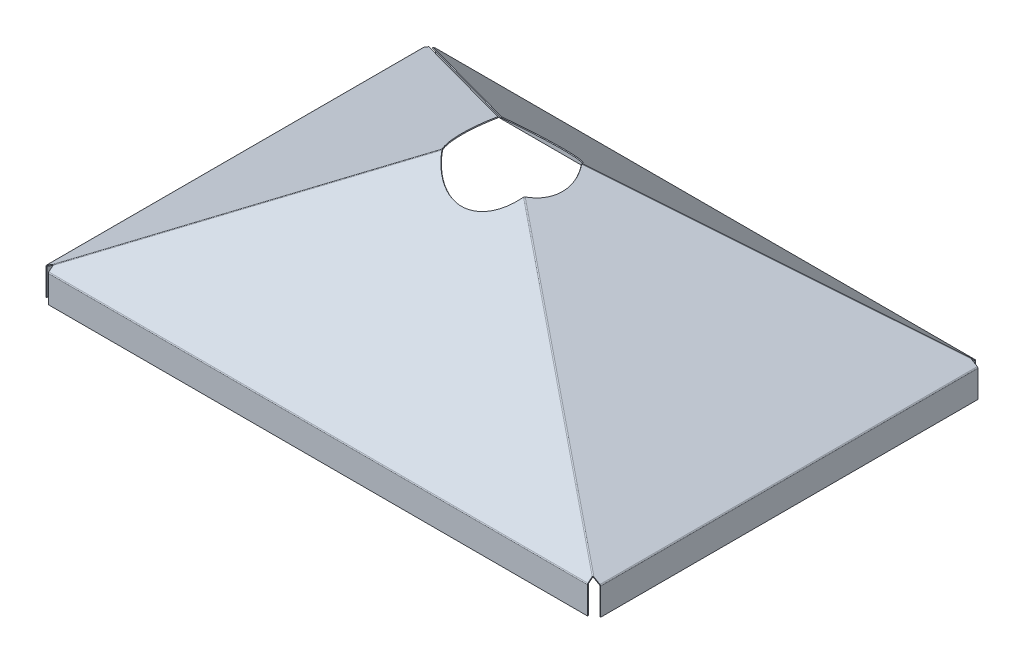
ISO-10303-21;
HEADER;
FILE_DESCRIPTION(('STEP AP214'),'2;1');
FILE_NAME('part.step','',(''),(''),'','','');
FILE_SCHEMA(('AUTOMOTIVE_DESIGN { 1 0 10303 214 1 1 1 1 }'));
ENDSEC;
DATA;
#1=APPLICATION_CONTEXT('core data for automotive mechanical design processes');
#2=APPLICATION_PROTOCOL_DEFINITION('international standard','automotive_design',2000,#1);
#3=PRODUCT_CONTEXT('',#1,'mechanical');
#4=PRODUCT('Part','Part','',(#3));
#5=PRODUCT_RELATED_PRODUCT_CATEGORY('part','',(#4));
#6=PRODUCT_DEFINITION_FORMATION('','',#4);
#7=PRODUCT_DEFINITION_CONTEXT('part definition',#1,'design');
#8=PRODUCT_DEFINITION('design','',#6,#7);
#9=PRODUCT_DEFINITION_SHAPE('','',#8);
#10=(LENGTH_UNIT() NAMED_UNIT(*) SI_UNIT(.MILLI.,.METRE.));
#11=(NAMED_UNIT(*) PLANE_ANGLE_UNIT() SI_UNIT($,.RADIAN.));
#12=(NAMED_UNIT(*) SI_UNIT($,.STERADIAN.) SOLID_ANGLE_UNIT());
#13=UNCERTAINTY_MEASURE_WITH_UNIT(LENGTH_MEASURE(1.E-05),#10,'distance_accuracy_value','');
#14=(GEOMETRIC_REPRESENTATION_CONTEXT(3) GLOBAL_UNCERTAINTY_ASSIGNED_CONTEXT((#13)) GLOBAL_UNIT_ASSIGNED_CONTEXT((#10,
#11,#12)) REPRESENTATION_CONTEXT('',''));
#15=CARTESIAN_POINT('',(0.,0.,0.));
#16=DIRECTION('',(0.,0.,1.));
#17=DIRECTION('',(1.,0.,0.));
#18=AXIS2_PLACEMENT_3D('',#15,#16,#17);
#19=CARTESIAN_POINT('',(-32.8128451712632,-4.78783679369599E-13,1961.2936325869));
#20=DIRECTION('',(0.,-1.,0.));
#21=DIRECTION('',(0.,0.,-1.));
#22=AXIS2_PLACEMENT_3D('',#19,#20,#21);
#23=PLANE('',#22);
#24=DIRECTION('',(-1.,0.,0.));
#25=VECTOR('',#24,1.);
#26=CARTESIAN_POINT('',(-32.812845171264,0.,-53.4137900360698));
#27=LINE('',#26,#25);
#28=CARTESIAN_POINT('',(953.26965903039,0.,-53.41379003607));
#29=VERTEX_POINT('',#28);
#30=CARTESIAN_POINT('',(-18.8953493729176,-1.17961196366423E-13,-53.4137900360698));
#31=VERTEX_POINT('',#30);
#32=EDGE_CURVE('E398',#29,#31,#27,.T.);
#33=ORIENTED_EDGE('',*,*,#32,.F.);
#34=DIRECTION('',(0.,0.,-1.));
#35=VECTOR('',#34,1.);
#36=CARTESIAN_POINT('',(953.269659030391,-6.03683769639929E-13,1961.2936325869));
#37=LINE('',#36,#35);
#38=CARTESIAN_POINT('',(953.26965903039,0.,-51.9137900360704));
#39=VERTEX_POINT('',#38);
#40=EDGE_CURVE('E11',#39,#29,#37,.T.);
#41=ORIENTED_EDGE('',*,*,#40,.F.);
#42=DIRECTION('',(-1.,0.,0.));
#43=VECTOR('',#42,1.);
#44=CARTESIAN_POINT('',(-32.812845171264,0.,-51.9137900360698));
#45=LINE('',#44,#43);
#46=CARTESIAN_POINT('',(-18.8953493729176,1.45716771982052E-13,-51.9137900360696));
#47=VERTEX_POINT('',#46);
#48=EDGE_CURVE('E52',#39,#47,#45,.T.);
#49=ORIENTED_EDGE('',*,*,#48,.T.);
#50=DIRECTION('',(0.,0.,-1.));
#51=VECTOR('',#50,1.);
#52=CARTESIAN_POINT('',(-18.8953493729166,-3.60822483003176E-13,1961.29363258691));
#53=LINE('',#52,#51);
#54=EDGE_CURVE('E403',#47,#31,#53,.T.);
#55=ORIENTED_EDGE('',*,*,#54,.T.);
#56=EDGE_LOOP('',(#33,#41,#49,#55));
#57=FACE_BOUND('',#56,.T.);
#58=ADVANCED_FACE('F33',(#57),#23,.T.);
#59=CARTESIAN_POINT('',(-18.8953493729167,300.,1961.2936325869));
#60=DIRECTION('',(-1.,0.,0.));
#61=DIRECTION('',(0.,0.790898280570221,-0.611947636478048));
#62=AXIS2_PLACEMENT_3D('',#59,#60,#61);
#63=PLANE('',#62);
#64=DIRECTION('',(0.,1.,0.));
#65=VECTOR('',#64,1.);
#66=CARTESIAN_POINT('',(-18.8953493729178,300.,-53.4137900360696));
#67=LINE('',#66,#65);
#68=CARTESIAN_POINT('',(-18.8953493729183,48.83309989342,-53.4137900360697));
#69=VERTEX_POINT('',#68);
#70=EDGE_CURVE('E66',#31,#69,#67,.T.);
#71=ORIENTED_EDGE('',*,*,#70,.F.);
#72=ORIENTED_EDGE('',*,*,#54,.F.);
#73=DIRECTION('',(0.,1.,0.));
#74=VECTOR('',#73,1.);
#75=CARTESIAN_POINT('',(-18.8953493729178,300.,-51.9137900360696));
#76=LINE('',#75,#74);
#77=CARTESIAN_POINT('',(-18.8953493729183,48.83309989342,-51.9137900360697));
#78=VERTEX_POINT('',#77);
#79=EDGE_CURVE('E393',#47,#78,#76,.T.);
#80=ORIENTED_EDGE('',*,*,#79,.T.);
#81=DIRECTION('',(0.,0.,-1.));
#82=VECTOR('',#81,1.);
#83=CARTESIAN_POINT('',(-18.8953493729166,48.8330998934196,1961.2936325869));
#84=LINE('',#83,#82);
#85=EDGE_CURVE('E386',#78,#69,#84,.T.);
#86=ORIENTED_EDGE('',*,*,#85,.T.);
#87=EDGE_LOOP('',(#71,#72,#80,#86));
#88=FACE_BOUND('',#87,.T.);
#89=ADVANCED_FACE('F392',(#88),#63,.T.);
#90=CARTESIAN_POINT('',(-32.8128451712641,300.,-53.4137900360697));
#91=DIRECTION('',(0.,0.,1.));
#92=DIRECTION('',(1.,0.,0.));
#93=AXIS2_PLACEMENT_3D('',#90,#91,#92);
#94=PLANE('',#93);
#95=ORIENTED_EDGE('',*,*,#70,.T.);
#96=DIRECTION('',(1.,0.,0.));
#97=VECTOR('',#96,1.);
#98=CARTESIAN_POINT('',(-18.8953493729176,48.8330998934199,-53.41379003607));
#99=LINE('',#98,#97);
#100=CARTESIAN_POINT('',(953.26965903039,48.8330998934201,-53.4137900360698));
#101=VERTEX_POINT('',#100);
#102=EDGE_CURVE('E374',#69,#101,#99,.T.);
#103=ORIENTED_EDGE('',*,*,#102,.T.);
#104=DIRECTION('',(0.,-1.,0.));
#105=VECTOR('',#104,1.);
#106=CARTESIAN_POINT('',(953.26965903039,300.,-53.4137900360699));
#107=LINE('',#106,#105);
#108=EDGE_CURVE('E380',#101,#29,#107,.T.);
#109=ORIENTED_EDGE('',*,*,#108,.T.);
#110=ORIENTED_EDGE('',*,*,#32,.T.);
#111=EDGE_LOOP('',(#95,#103,#109,#110));
#112=FACE_BOUND('',#111,.T.);
#113=ADVANCED_FACE('F396',(#112),#94,.F.);
#114=CARTESIAN_POINT('',(953.269659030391,300.,1961.2936325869));
#115=DIRECTION('',(1.,0.,0.));
#116=DIRECTION('',(0.,-0.790898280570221,0.611947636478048));
#117=AXIS2_PLACEMENT_3D('',#114,#115,#116);
#118=PLANE('',#117);
#119=ORIENTED_EDGE('',*,*,#108,.F.);
#120=DIRECTION('',(0.,0.,-1.));
#121=VECTOR('',#120,1.);
#122=CARTESIAN_POINT('',(953.269659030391,48.8330998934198,1961.2936325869));
#123=LINE('',#122,#121);
#124=CARTESIAN_POINT('',(953.269659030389,48.8330998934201,-51.9137900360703));
#125=VERTEX_POINT('',#124);
#126=EDGE_CURVE('E405',#125,#101,#123,.T.);
#127=ORIENTED_EDGE('',*,*,#126,.F.);
#128=DIRECTION('',(0.,-1.,0.));
#129=VECTOR('',#128,1.);
#130=CARTESIAN_POINT('',(953.26965903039,300.,-51.9137900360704));
#131=LINE('',#130,#129);
#132=EDGE_CURVE('E43',#125,#39,#131,.T.);
#133=ORIENTED_EDGE('',*,*,#132,.T.);
#134=ORIENTED_EDGE('',*,*,#40,.T.);
#135=EDGE_LOOP('',(#119,#127,#133,#134));
#136=FACE_BOUND('',#135,.T.);
#137=ADVANCED_FACE('F450',(#136),#118,.T.);
#138=CARTESIAN_POINT('',(-32.8128451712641,300.,-51.9137900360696));
#139=DIRECTION('',(0.,0.,1.));
#140=DIRECTION('',(1.,0.,0.));
#141=AXIS2_PLACEMENT_3D('',#138,#139,#140);
#142=PLANE('',#141);
#143=DIRECTION('',(1.,0.,0.));
#144=VECTOR('',#143,1.);
#145=CARTESIAN_POINT('',(-18.8953493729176,48.83309989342,-51.9137900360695));
#146=LINE('',#145,#144);
#147=EDGE_CURVE('E37',#78,#125,#146,.T.);
#148=ORIENTED_EDGE('',*,*,#147,.F.);
#149=ORIENTED_EDGE('',*,*,#79,.F.);
#150=ORIENTED_EDGE('',*,*,#48,.F.);
#151=ORIENTED_EDGE('',*,*,#132,.F.);
#152=EDGE_LOOP('',(#148,#149,#150,#151));
#153=FACE_BOUND('',#152,.T.);
#154=ADVANCED_FACE('F35',(#153),#142,.T.);
#155=CARTESIAN_POINT('',(-32.8128451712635,1.11022302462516E-13,-1300.19521095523));
#156=DIRECTION('',(0.,-1.,0.));
#157=DIRECTION('',(0.,0.,-1.));
#158=AXIS2_PLACEMENT_3D('',#155,#156,#157);
#159=PLANE('',#158);
#160=DIRECTION('',(1.,0.,0.));
#161=VECTOR('',#160,1.);
#162=CARTESIAN_POINT('',(-32.8128451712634,-1.11022302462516E-13,646.58620996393));
#163=LINE('',#162,#161);
#164=CARTESIAN_POINT('',(-18.8953493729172,-1.11022302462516E-13,646.58620996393));
#165=VERTEX_POINT('',#164);
#166=CARTESIAN_POINT('',(953.26965903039,-2.22044604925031E-13,646.58620996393));
#167=VERTEX_POINT('',#166);
#168=EDGE_CURVE('E420',#165,#167,#163,.T.);
#169=ORIENTED_EDGE('',*,*,#168,.F.);
#170=DIRECTION('',(0.,0.,1.));
#171=VECTOR('',#170,1.);
#172=CARTESIAN_POINT('',(-18.8953493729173,1.11022302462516E-13,-1300.19521095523));
#173=LINE('',#172,#171);
#174=CARTESIAN_POINT('',(-18.8953493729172,-1.11022302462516E-13,645.08620996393));
#175=VERTEX_POINT('',#174);
#176=EDGE_CURVE('E410',#175,#165,#173,.T.);
#177=ORIENTED_EDGE('',*,*,#176,.F.);
#178=DIRECTION('',(1.,0.,0.));
#179=VECTOR('',#178,1.);
#180=CARTESIAN_POINT('',(-32.8128451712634,0.,645.08620996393));
#181=LINE('',#180,#179);
#182=CARTESIAN_POINT('',(953.26965903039,0.,645.08620996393));
#183=VERTEX_POINT('',#182);
#184=EDGE_CURVE('E83',#175,#183,#181,.T.);
#185=ORIENTED_EDGE('',*,*,#184,.T.);
#186=DIRECTION('',(0.,0.,1.));
#187=VECTOR('',#186,1.);
#188=CARTESIAN_POINT('',(953.26965903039,1.11022302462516E-13,-1300.19521095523));
#189=LINE('',#188,#187);
#190=EDGE_CURVE('E440',#183,#167,#189,.T.);
#191=ORIENTED_EDGE('',*,*,#190,.T.);
#192=EDGE_LOOP('',(#169,#177,#185,#191));
#193=FACE_BOUND('',#192,.T.);
#194=ADVANCED_FACE('F468',(#193),#159,.T.);
#195=CARTESIAN_POINT('',(953.26965903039,300.,-1300.19521095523));
#196=DIRECTION('',(1.,0.,0.));
#197=DIRECTION('',(0.,0.766521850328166,-0.642218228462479));
#198=AXIS2_PLACEMENT_3D('',#195,#196,#197);
#199=PLANE('',#198);
#200=DIRECTION('',(0.,1.,0.));
#201=VECTOR('',#200,1.);
#202=CARTESIAN_POINT('',(953.26965903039,300.,646.58620996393));
#203=LINE('',#202,#201);
#204=CARTESIAN_POINT('',(953.26965903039,48.83309989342,646.58620996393));
#205=VERTEX_POINT('',#204);
#206=EDGE_CURVE('E106',#167,#205,#203,.T.);
#207=ORIENTED_EDGE('',*,*,#206,.F.);
#208=ORIENTED_EDGE('',*,*,#190,.F.);
#209=DIRECTION('',(0.,1.,0.));
#210=VECTOR('',#209,1.);
#211=CARTESIAN_POINT('',(953.26965903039,300.,645.08620996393));
#212=LINE('',#211,#210);
#213=CARTESIAN_POINT('',(953.26965903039,48.83309989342,645.08620996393));
#214=VERTEX_POINT('',#213);
#215=EDGE_CURVE('E437',#183,#214,#212,.T.);
#216=ORIENTED_EDGE('',*,*,#215,.T.);
#217=DIRECTION('',(0.,0.,1.));
#218=VECTOR('',#217,1.);
#219=CARTESIAN_POINT('',(953.26965903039,48.8330998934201,-1300.19521095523));
#220=LINE('',#219,#218);
#221=EDGE_CURVE('E435',#214,#205,#220,.T.);
#222=ORIENTED_EDGE('',*,*,#221,.T.);
#223=EDGE_LOOP('',(#207,#208,#216,#222));
#224=FACE_BOUND('',#223,.T.);
#225=ADVANCED_FACE('F472',(#224),#199,.T.);
#226=CARTESIAN_POINT('',(-32.8128451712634,300.,646.58620996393));
#227=DIRECTION('',(0.,0.,-1.));
#228=DIRECTION('',(-1.,0.,0.));
#229=AXIS2_PLACEMENT_3D('',#226,#227,#228);
#230=PLANE('',#229);
#231=ORIENTED_EDGE('',*,*,#206,.T.);
#232=DIRECTION('',(-1.,0.,0.));
#233=VECTOR('',#232,1.);
#234=CARTESIAN_POINT('',(953.26965903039,48.8330998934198,646.58620996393));
#235=LINE('',#234,#233);
#236=CARTESIAN_POINT('',(-18.8953493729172,48.83309989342,646.58620996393));
#237=VERTEX_POINT('',#236);
#238=EDGE_CURVE('E431',#205,#237,#235,.T.);
#239=ORIENTED_EDGE('',*,*,#238,.T.);
#240=DIRECTION('',(0.,-1.,0.));
#241=VECTOR('',#240,1.);
#242=CARTESIAN_POINT('',(-18.8953493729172,300.,646.58620996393));
#243=LINE('',#242,#241);
#244=EDGE_CURVE('E428',#237,#165,#243,.T.);
#245=ORIENTED_EDGE('',*,*,#244,.T.);
#246=ORIENTED_EDGE('',*,*,#168,.T.);
#247=EDGE_LOOP('',(#231,#239,#245,#246));
#248=FACE_BOUND('',#247,.T.);
#249=ADVANCED_FACE('F478',(#248),#230,.F.);
#250=CARTESIAN_POINT('',(-18.8953493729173,300.,-1300.19521095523));
#251=DIRECTION('',(-1.,0.,0.));
#252=DIRECTION('',(0.,-0.766521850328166,0.642218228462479));
#253=AXIS2_PLACEMENT_3D('',#250,#251,#252);
#254=PLANE('',#253);
#255=ORIENTED_EDGE('',*,*,#244,.F.);
#256=DIRECTION('',(0.,0.,1.));
#257=VECTOR('',#256,1.);
#258=CARTESIAN_POINT('',(-18.8953493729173,48.8330998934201,-1300.19521095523));
#259=LINE('',#258,#257);
#260=CARTESIAN_POINT('',(-18.8953493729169,48.8330998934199,645.08620996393));
#261=VERTEX_POINT('',#260);
#262=EDGE_CURVE('E443',#261,#237,#259,.T.);
#263=ORIENTED_EDGE('',*,*,#262,.F.);
#264=DIRECTION('',(0.,-1.,0.));
#265=VECTOR('',#264,1.);
#266=CARTESIAN_POINT('',(-18.8953493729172,300.,645.08620996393));
#267=LINE('',#266,#265);
#268=EDGE_CURVE('E414',#261,#175,#267,.T.);
#269=ORIENTED_EDGE('',*,*,#268,.T.);
#270=ORIENTED_EDGE('',*,*,#176,.T.);
#271=EDGE_LOOP('',(#255,#263,#269,#270));
#272=FACE_BOUND('',#271,.T.);
#273=ADVANCED_FACE('F485',(#272),#254,.T.);
#274=CARTESIAN_POINT('',(-32.8128451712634,300.,645.08620996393));
#275=DIRECTION('',(0.,0.,-1.));
#276=DIRECTION('',(-1.,0.,0.));
#277=AXIS2_PLACEMENT_3D('',#274,#275,#276);
#278=PLANE('',#277);
#279=DIRECTION('',(-1.,0.,0.));
#280=VECTOR('',#279,1.);
#281=CARTESIAN_POINT('',(953.26965903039,48.8330998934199,645.08620996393));
#282=LINE('',#281,#280);
#283=EDGE_CURVE('E445',#214,#261,#282,.T.);
#284=ORIENTED_EDGE('',*,*,#283,.F.);
#285=ORIENTED_EDGE('',*,*,#215,.F.);
#286=ORIENTED_EDGE('',*,*,#184,.F.);
#287=ORIENTED_EDGE('',*,*,#268,.F.);
#288=EDGE_LOOP('',(#284,#285,#286,#287));
#289=FACE_BOUND('',#288,.T.);
#290=ADVANCED_FACE('F460',(#289),#278,.T.);
#291=CARTESIAN_POINT('',(1368.35450163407,-2.84494650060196E-13,-53.4137900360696));
#292=DIRECTION('',(0.,-1.,0.));
#293=DIRECTION('',(-0.634843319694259,0.,0.772640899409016));
#294=AXIS2_PLACEMENT_3D('',#291,#292,#293);
#295=PLANE('',#294);
#296=DIRECTION('',(0.,0.,1.));
#297=VECTOR('',#296,1.);
#298=CARTESIAN_POINT('',(-32.8128451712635,-1.2490009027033E-13,-53.4137900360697));
#299=LINE('',#298,#297);
#300=CARTESIAN_POINT('',(-32.8128451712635,-1.2490009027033E-13,-43.6715429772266));
#301=VERTEX_POINT('',#300);
#302=CARTESIAN_POINT('',(-32.8128451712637,0.,636.843962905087));
#303=VERTEX_POINT('',#302);
#304=EDGE_CURVE('E1705',#301,#303,#299,.T.);
#305=ORIENTED_EDGE('',*,*,#304,.F.);
#306=DIRECTION('',(-1.,0.,0.));
#307=VECTOR('',#306,1.);
#308=CARTESIAN_POINT('',(1368.35450163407,-1.73472347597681E-13,-43.6715429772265));
#309=LINE('',#308,#307);
#310=CARTESIAN_POINT('',(-31.3128451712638,-1.11022302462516E-13,-43.6715429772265));
#311=VERTEX_POINT('',#310);
#312=EDGE_CURVE('E446',#311,#301,#309,.T.);
#313=ORIENTED_EDGE('',*,*,#312,.F.);
#314=DIRECTION('',(0.,0.,1.));
#315=VECTOR('',#314,1.);
#316=CARTESIAN_POINT('',(-31.3128451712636,0.,-53.4137900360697));
#317=LINE('',#316,#315);
#318=CARTESIAN_POINT('',(-31.3128451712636,0.,636.843962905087));
#319=VERTEX_POINT('',#318);
#320=EDGE_CURVE('E115',#311,#319,#317,.T.);
#321=ORIENTED_EDGE('',*,*,#320,.T.);
#322=DIRECTION('',(-1.,0.,0.));
#323=VECTOR('',#322,1.);
#324=CARTESIAN_POINT('',(1368.35450163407,-1.73472347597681E-13,636.843962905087));
#325=LINE('',#324,#323);
#326=EDGE_CURVE('E1707',#319,#303,#325,.T.);
#327=ORIENTED_EDGE('',*,*,#326,.T.);
#328=EDGE_LOOP('',(#305,#313,#321,#327));
#329=FACE_BOUND('',#328,.T.);
#330=ADVANCED_FACE('F491',(#329),#295,.T.);
#331=CARTESIAN_POINT('',(1368.35450163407,300.,636.843962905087));
#332=DIRECTION('',(0.,0.,1.));
#333=DIRECTION('',(1.,0.,0.));
#334=AXIS2_PLACEMENT_3D('',#331,#332,#333);
#335=PLANE('',#334);
#336=DIRECTION('',(0.,1.,0.));
#337=VECTOR('',#336,1.);
#338=CARTESIAN_POINT('',(-32.8128451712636,300.,636.843962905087));
#339=LINE('',#338,#337);
#340=CARTESIAN_POINT('',(-32.8128451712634,48.5679739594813,636.843962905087));
#341=VERTEX_POINT('',#340);
#342=EDGE_CURVE('E130',#303,#341,#339,.T.);
#343=ORIENTED_EDGE('',*,*,#342,.F.);
#344=ORIENTED_EDGE('',*,*,#326,.F.);
#345=DIRECTION('',(0.,1.,0.));
#346=VECTOR('',#345,1.);
#347=CARTESIAN_POINT('',(-31.3128451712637,300.,636.843962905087));
#348=LINE('',#347,#346);
#349=CARTESIAN_POINT('',(-31.3128451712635,48.5679739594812,636.843962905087));
#350=VERTEX_POINT('',#349);
#351=EDGE_CURVE('E1721',#319,#350,#348,.T.);
#352=ORIENTED_EDGE('',*,*,#351,.T.);
#353=DIRECTION('',(-1.,0.,0.));
#354=VECTOR('',#353,1.);
#355=CARTESIAN_POINT('',(1368.35450163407,48.5679739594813,636.843962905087));
#356=LINE('',#355,#354);
#357=EDGE_CURVE('E1719',#350,#341,#356,.T.);
#358=ORIENTED_EDGE('',*,*,#357,.T.);
#359=EDGE_LOOP('',(#343,#344,#352,#358));
#360=FACE_BOUND('',#359,.T.);
#361=ADVANCED_FACE('F1631',(#360),#335,.T.);
#362=CARTESIAN_POINT('',(-32.8128451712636,300.,-53.4137900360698));
#363=DIRECTION('',(1.,0.,0.));
#364=DIRECTION('',(0.,0.,-1.));
#365=AXIS2_PLACEMENT_3D('',#362,#363,#364);
#366=PLANE('',#365);
#367=ORIENTED_EDGE('',*,*,#342,.T.);
#368=DIRECTION('',(0.,0.,-1.));
#369=VECTOR('',#368,1.);
#370=CARTESIAN_POINT('',(-32.8128451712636,48.5679739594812,636.843962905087));
#371=LINE('',#370,#369);
#372=CARTESIAN_POINT('',(-32.8128451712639,48.5679739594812,-43.6715429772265));
#373=VERTEX_POINT('',#372);
#374=EDGE_CURVE('E1713',#341,#373,#371,.T.);
#375=ORIENTED_EDGE('',*,*,#374,.T.);
#376=DIRECTION('',(0.,-1.,0.));
#377=VECTOR('',#376,1.);
#378=CARTESIAN_POINT('',(-32.8128451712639,300.,-43.6715429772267));
#379=LINE('',#378,#377);
#380=EDGE_CURVE('E1709',#373,#301,#379,.T.);
#381=ORIENTED_EDGE('',*,*,#380,.T.);
#382=ORIENTED_EDGE('',*,*,#304,.T.);
#383=EDGE_LOOP('',(#367,#375,#381,#382));
#384=FACE_BOUND('',#383,.T.);
#385=ADVANCED_FACE('F1622',(#384),#366,.F.);
#386=CARTESIAN_POINT('',(1368.35450163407,300.,-43.6715429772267));
#387=DIRECTION('',(0.,0.,-1.));
#388=DIRECTION('',(-1.,0.,0.));
#389=AXIS2_PLACEMENT_3D('',#386,#387,#388);
#390=PLANE('',#389);
#391=ORIENTED_EDGE('',*,*,#380,.F.);
#392=DIRECTION('',(-1.,0.,0.));
#393=VECTOR('',#392,1.);
#394=CARTESIAN_POINT('',(1368.35450163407,48.5679739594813,-43.6715429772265));
#395=LINE('',#394,#393);
#396=CARTESIAN_POINT('',(-31.3128451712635,48.5679739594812,-43.6715429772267));
#397=VERTEX_POINT('',#396);
#398=EDGE_CURVE('E1725',#397,#373,#395,.T.);
#399=ORIENTED_EDGE('',*,*,#398,.F.);
#400=DIRECTION('',(0.,-1.,0.));
#401=VECTOR('',#400,1.);
#402=CARTESIAN_POINT('',(-31.3128451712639,300.,-43.6715429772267));
#403=LINE('',#402,#401);
#404=EDGE_CURVE('E1708',#397,#311,#403,.T.);
#405=ORIENTED_EDGE('',*,*,#404,.T.);
#406=ORIENTED_EDGE('',*,*,#312,.T.);
#407=EDGE_LOOP('',(#391,#399,#405,#406));
#408=FACE_BOUND('',#407,.T.);
#409=ADVANCED_FACE('F1614',(#408),#390,.T.);
#410=CARTESIAN_POINT('',(-31.3128451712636,300.,-53.4137900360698));
#411=DIRECTION('',(1.,0.,0.));
#412=DIRECTION('',(0.,0.,-1.));
#413=AXIS2_PLACEMENT_3D('',#410,#411,#412);
#414=PLANE('',#413);
#415=DIRECTION('',(0.,0.,-1.));
#416=VECTOR('',#415,1.);
#417=CARTESIAN_POINT('',(-31.3128451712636,48.5679739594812,636.843962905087));
#418=LINE('',#417,#416);
#419=EDGE_CURVE('E423',#350,#397,#418,.T.);
#420=ORIENTED_EDGE('',*,*,#419,.F.);
#421=ORIENTED_EDGE('',*,*,#351,.F.);
#422=ORIENTED_EDGE('',*,*,#320,.F.);
#423=ORIENTED_EDGE('',*,*,#404,.F.);
#424=EDGE_LOOP('',(#420,#421,#422,#423));
#425=FACE_BOUND('',#424,.T.);
#426=ADVANCED_FACE('F481',(#425),#414,.T.);
#427=CARTESIAN_POINT('',(1714.92145420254,-946.073041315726,555.59263047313));
#428=DIRECTION('',(-0.44587074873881,-0.261496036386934,0.856048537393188));
#429=DIRECTION('',(0.505897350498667,-0.862593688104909,0.));
#430=AXIS2_PLACEMENT_3D('',#427,#428,#429);
#431=PLANE('',#430);
#432=DIRECTION('',(-0.738422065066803,-0.433072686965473,-0.516895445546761));
#433=VECTOR('',#432,1.);
#434=CARTESIAN_POINT('',(832.949893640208,557.755947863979,555.59263047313));
#435=LINE('',#434,#433);
#436=CARTESIAN_POINT('',(391.568718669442,298.892974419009,246.625807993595));
#437=VERTEX_POINT('',#436);
#438=CARTESIAN_POINT('',(-23.141782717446,55.6719228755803,-43.6715429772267));
#439=VERTEX_POINT('',#438);
#440=EDGE_CURVE('E1358',#437,#439,#435,.T.);
#441=ORIENTED_EDGE('',*,*,#440,.F.);
#442=DIRECTION('',(-0.505897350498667,0.862593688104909,0.));
#443=VECTOR('',#442,1.);
#444=CARTESIAN_POINT('',(1273.54027923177,-1204.9360147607,246.625807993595));
#445=LINE('',#444,#443);
#446=CARTESIAN_POINT('',(392.327564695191,297.599083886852,246.625807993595));
#447=VERTEX_POINT('',#446);
#448=EDGE_CURVE('E1363',#447,#437,#445,.T.);
#449=ORIENTED_EDGE('',*,*,#448,.F.);
#450=DIRECTION('',(0.738422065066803,0.433072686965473,0.516895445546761));
#451=VECTOR('',#450,1.);
#452=CARTESIAN_POINT('',(833.708739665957,556.462057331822,555.59263047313));
#453=LINE('',#452,#451);
#454=CARTESIAN_POINT('',(-22.3829366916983,54.3780323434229,-43.6715429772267));
#455=VERTEX_POINT('',#454);
#456=EDGE_CURVE('E959',#455,#447,#453,.T.);
#457=ORIENTED_EDGE('',*,*,#456,.F.);
#458=DIRECTION('',(-0.505897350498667,0.862593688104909,0.));
#459=VECTOR('',#458,1.);
#460=CARTESIAN_POINT('',(858.829777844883,-1448.15706630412,-43.6715429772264));
#461=LINE('',#460,#459);
#462=EDGE_CURVE('E1346',#455,#439,#461,.T.);
#463=ORIENTED_EDGE('',*,*,#462,.T.);
#464=EDGE_LOOP('',(#441,#449,#457,#463));
#465=FACE_BOUND('',#464,.T.);
#466=ADVANCED_FACE('F1016',(#465),#431,.F.);
#467=CARTESIAN_POINT('',(849.158715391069,-1453.8289891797,-43.6715429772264));
#468=DIRECTION('',(0.,0.,1.));
#469=DIRECTION('',(0.505897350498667,-0.862593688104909,0.));
#470=AXIS2_PLACEMENT_3D('',#467,#468,#469);
#471=PLANE('',#470);
#472=DIRECTION('',(0.862593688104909,0.505897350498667,0.));
#473=VECTOR('',#472,1.);
#474=CARTESIAN_POINT('',(-32.8128451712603,50.0000000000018,-43.6715429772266));
#475=LINE('',#474,#473);
#476=CARTESIAN_POINT('',(-31.5775885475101,50.7244581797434,-43.6715429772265));
#477=VERTEX_POINT('',#476);
#478=EDGE_CURVE('E183',#477,#439,#475,.T.);
#479=ORIENTED_EDGE('',*,*,#478,.T.);
#480=ORIENTED_EDGE('',*,*,#462,.F.);
#481=DIRECTION('',(0.862593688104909,0.505897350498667,0.));
#482=VECTOR('',#481,1.);
#483=CARTESIAN_POINT('',(-32.0539991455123,48.7061094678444,-43.6715429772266));
#484=LINE('',#483,#482);
#485=CARTESIAN_POINT('',(-30.8187425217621,49.4305676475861,-43.6715429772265));
#486=VERTEX_POINT('',#485);
#487=EDGE_CURVE('E177',#486,#455,#484,.T.);
#488=ORIENTED_EDGE('',*,*,#487,.F.);
#489=DIRECTION('',(-0.505897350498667,0.862593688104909,0.));
#490=VECTOR('',#489,1.);
#491=CARTESIAN_POINT('',(850.393972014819,-1453.10453099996,-43.6715429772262));
#492=LINE('',#491,#490);
#493=EDGE_CURVE('E1370',#486,#477,#492,.T.);
#494=ORIENTED_EDGE('',*,*,#493,.T.);
#495=EDGE_LOOP('',(#479,#480,#488,#494));
#496=FACE_BOUND('',#495,.T.);
#497=ADVANCED_FACE('F1013',(#496),#471,.F.);
#498=CARTESIAN_POINT('',(849.158715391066,-1453.8289891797,636.843962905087));
#499=DIRECTION('',(0.,0.,-1.));
#500=DIRECTION('',(-0.505897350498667,0.862593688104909,0.));
#501=AXIS2_PLACEMENT_3D('',#498,#499,#500);
#502=PLANE('',#501);
#503=DIRECTION('',(-0.862593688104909,-0.505897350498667,0.));
#504=VECTOR('',#503,1.);
#505=CARTESIAN_POINT('',(-32.8128451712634,50.,636.843962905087));
#506=LINE('',#505,#504);
#507=CARTESIAN_POINT('',(-20.779461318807,57.057386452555,636.843962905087));
#508=VERTEX_POINT('',#507);
#509=CARTESIAN_POINT('',(-31.5775885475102,50.7244581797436,636.843962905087));
#510=VERTEX_POINT('',#509);
#511=EDGE_CURVE('E1352',#508,#510,#506,.T.);
#512=ORIENTED_EDGE('',*,*,#511,.T.);
#513=DIRECTION('',(-0.505897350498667,0.862593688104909,0.));
#514=VECTOR('',#513,1.);
#515=CARTESIAN_POINT('',(850.393972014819,-1453.10453099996,636.843962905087));
#516=LINE('',#515,#514);
#517=CARTESIAN_POINT('',(-30.8187425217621,49.4305676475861,636.843962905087));
#518=VERTEX_POINT('',#517);
#519=EDGE_CURVE('E1354',#518,#510,#516,.T.);
#520=ORIENTED_EDGE('',*,*,#519,.F.);
#521=DIRECTION('',(-0.862593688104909,-0.505897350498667,0.));
#522=VECTOR('',#521,1.);
#523=CARTESIAN_POINT('',(-32.0539991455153,48.7061094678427,636.843962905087));
#524=LINE('',#523,#522);
#525=CARTESIAN_POINT('',(-20.0206152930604,55.7634959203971,636.843962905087));
#526=VERTEX_POINT('',#525);
#527=EDGE_CURVE('E988',#526,#518,#524,.T.);
#528=ORIENTED_EDGE('',*,*,#527,.F.);
#529=CARTESIAN_POINT('',(-20.7794613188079,57.0573864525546,636.843962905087));
#530=CARTESIAN_POINT('',(-20.0206152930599,55.7634959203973,636.843962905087));
#531=B_SPLINE_CURVE_WITH_KNOTS('',1,(#529,#530),.UNSPECIFIED.,.F.,.F.,(2,2),(0.,1.),.UNSPECIFIED.);
#532=EDGE_CURVE('E999',#526,#508,#531,.F.);
#533=ORIENTED_EDGE('',*,*,#532,.T.);
#534=EDGE_LOOP('',(#512,#520,#528,#533));
#535=FACE_BOUND('',#534,.T.);
#536=ADVANCED_FACE('F1004',(#535),#502,.F.);
#537=CARTESIAN_POINT('',(-32.8128451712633,50.0000000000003,2217.811846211));
#538=DIRECTION('',(-0.505897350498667,0.862593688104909,0.));
#539=DIRECTION('',(-0.862593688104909,-0.505897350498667,0.));
#540=AXIS2_PLACEMENT_3D('',#537,#538,#539);
#541=PLANE('',#540);
#542=ORIENTED_EDGE('',*,*,#478,.F.);
#543=DIRECTION('',(0.,0.,1.));
#544=VECTOR('',#543,1.);
#545=CARTESIAN_POINT('',(-31.5775885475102,50.7244581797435,636.843962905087));
#546=LINE('',#545,#544);
#547=EDGE_CURVE('E1359',#477,#510,#546,.T.);
#548=ORIENTED_EDGE('',*,*,#547,.T.);
#549=ORIENTED_EDGE('',*,*,#511,.F.);
#550=DIRECTION('',(-0.738422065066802,-0.433072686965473,0.516895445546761));
#551=VECTOR('',#550,1.);
#552=CARTESIAN_POINT('',(-20.7794613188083,57.0573864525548,636.843962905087));
#553=LINE('',#552,#551);
#554=CARTESIAN_POINT('',(392.32927728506,299.339029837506,347.667845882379));
#555=VERTEX_POINT('',#554);
#556=EDGE_CURVE('E1342',#555,#508,#553,.T.);
#557=ORIENTED_EDGE('',*,*,#556,.F.);
#558=CARTESIAN_POINT('',(466.428308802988,342.796922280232,296.58620996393));
#559=DIRECTION('',(-0.505897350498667,0.862593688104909,0.));
#560=DIRECTION('',(0.862593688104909,0.505897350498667,0.));
#561=AXIS2_PLACEMENT_3D('',#558,#559,#560);
#562=ELLIPSE('',#561,104.336492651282,89.9999999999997);
#563=EDGE_CURVE('E1357',#555,#437,#562,.F.);
#564=ORIENTED_EDGE('',*,*,#563,.T.);
#565=ORIENTED_EDGE('',*,*,#440,.T.);
#566=EDGE_LOOP('',(#542,#548,#549,#557,#564,#565));
#567=FACE_BOUND('',#566,.T.);
#568=ADVANCED_FACE('F968',(#567),#541,.T.);
#569=CARTESIAN_POINT('',(1348.39986936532,-1161.03206689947,296.58620996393));
#570=DIRECTION('',(-0.505897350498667,0.862593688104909,0.));
#571=DIRECTION('',(0.862593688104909,0.505897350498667,0.));
#572=AXIS2_PLACEMENT_3D('',#569,#570,#571);
#573=ELLIPSE('',#572,104.336492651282,89.9999999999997);
#574=DIRECTION('',(-0.505897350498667,0.862593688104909,0.));
#575=VECTOR('',#574,1.);
#576=SURFACE_OF_LINEAR_EXTRUSION('',#573,#575);
#577=ORIENTED_EDGE('',*,*,#563,.F.);
#578=CARTESIAN_POINT('',(393.088123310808,298.045139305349,347.667845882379));
#579=CARTESIAN_POINT('',(392.329277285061,299.339029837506,347.66784588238));
#580=B_SPLINE_CURVE_WITH_KNOTS('',1,(#578,#579),.UNSPECIFIED.,.F.,.F.,(2,2),(0.,1.),.UNSPECIFIED.);
#581=CARTESIAN_POINT('',(393.088123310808,298.045139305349,347.66784588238));
#582=VERTEX_POINT('',#581);
#583=EDGE_CURVE('E1339',#582,#555,#580,.T.);
#584=ORIENTED_EDGE('',*,*,#583,.F.);
#585=CARTESIAN_POINT('',(467.187154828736,341.503031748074,296.58620996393));
#586=DIRECTION('',(-0.505897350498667,0.862593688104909,0.));
#587=DIRECTION('',(0.862593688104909,0.505897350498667,0.));
#588=AXIS2_PLACEMENT_3D('',#585,#586,#587);
#589=ELLIPSE('',#588,104.336492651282,89.9999999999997);
#590=EDGE_CURVE('E147',#447,#582,#589,.T.);
#591=ORIENTED_EDGE('',*,*,#590,.F.);
#592=ORIENTED_EDGE('',*,*,#448,.T.);
#593=EDGE_LOOP('',(#577,#584,#591,#592));
#594=FACE_BOUND('',#593,.T.);
#595=ADVANCED_FACE('F962',(#594),#576,.F.);
#596=CARTESIAN_POINT('',(-32.0539991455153,48.706109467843,2217.811846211));
#597=DIRECTION('',(-0.505897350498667,0.862593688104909,0.));
#598=DIRECTION('',(-0.862593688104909,-0.505897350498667,0.));
#599=AXIS2_PLACEMENT_3D('',#596,#597,#598);
#600=PLANE('',#599);
#601=DIRECTION('',(0.,0.,1.));
#602=VECTOR('',#601,1.);
#603=CARTESIAN_POINT('',(-30.8187425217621,49.4305676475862,636.843962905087));
#604=LINE('',#603,#602);
#605=EDGE_CURVE('E1343',#486,#518,#604,.T.);
#606=ORIENTED_EDGE('',*,*,#605,.F.);
#607=ORIENTED_EDGE('',*,*,#487,.T.);
#608=ORIENTED_EDGE('',*,*,#456,.T.);
#609=ORIENTED_EDGE('',*,*,#590,.T.);
#610=DIRECTION('',(-0.738422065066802,-0.433072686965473,0.516895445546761));
#611=VECTOR('',#610,1.);
#612=CARTESIAN_POINT('',(-20.0206152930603,55.7634959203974,636.843962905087));
#613=LINE('',#612,#611);
#614=EDGE_CURVE('E983',#582,#526,#613,.T.);
#615=ORIENTED_EDGE('',*,*,#614,.T.);
#616=ORIENTED_EDGE('',*,*,#527,.T.);
#617=EDGE_LOOP('',(#606,#607,#608,#609,#615,#616));
#618=FACE_BOUND('',#617,.T.);
#619=ADVANCED_FACE('F967',(#618),#600,.F.);
#620=CARTESIAN_POINT('',(-433.980191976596,5.55111512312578E-13,-53.4137900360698));
#621=DIRECTION('',(0.,-1.,0.));
#622=DIRECTION('',(-0.634843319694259,0.,-0.772640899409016));
#623=AXIS2_PLACEMENT_3D('',#620,#621,#622);
#624=PLANE('',#623);
#625=DIRECTION('',(0.,0.,-1.));
#626=VECTOR('',#625,1.);
#627=CARTESIAN_POINT('',(967.187154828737,4.44089209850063E-13,-53.4137900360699));
#628=LINE('',#627,#626);
#629=CARTESIAN_POINT('',(967.187154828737,-2.22044604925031E-13,636.843962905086));
#630=VERTEX_POINT('',#629);
#631=CARTESIAN_POINT('',(967.187154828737,5.55111512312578E-13,-43.6715429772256));
#632=VERTEX_POINT('',#631);
#633=EDGE_CURVE('E1334',#630,#632,#628,.T.);
#634=ORIENTED_EDGE('',*,*,#633,.F.);
#635=DIRECTION('',(1.,0.,0.));
#636=VECTOR('',#635,1.);
#637=CARTESIAN_POINT('',(-433.980191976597,-3.33066907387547E-13,636.843962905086));
#638=LINE('',#637,#636);
#639=CARTESIAN_POINT('',(965.687154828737,0.,636.843962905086));
#640=VERTEX_POINT('',#639);
#641=EDGE_CURVE('E1083',#640,#630,#638,.T.);
#642=ORIENTED_EDGE('',*,*,#641,.F.);
#643=DIRECTION('',(0.,0.,-1.));
#644=VECTOR('',#643,1.);
#645=CARTESIAN_POINT('',(965.687154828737,3.33066907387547E-13,-53.4137900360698));
#646=LINE('',#645,#644);
#647=CARTESIAN_POINT('',(965.687154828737,3.33066907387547E-13,-43.6715429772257));
#648=VERTEX_POINT('',#647);
#649=EDGE_CURVE('E191',#640,#648,#646,.T.);
#650=ORIENTED_EDGE('',*,*,#649,.T.);
#651=DIRECTION('',(1.,0.,0.));
#652=VECTOR('',#651,1.);
#653=CARTESIAN_POINT('',(-433.980191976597,2.22044604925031E-13,-43.6715429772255));
#654=LINE('',#653,#652);
#655=EDGE_CURVE('E1320',#648,#632,#654,.T.);
#656=ORIENTED_EDGE('',*,*,#655,.T.);
#657=EDGE_LOOP('',(#634,#642,#650,#656));
#658=FACE_BOUND('',#657,.T.);
#659=ADVANCED_FACE('F1035',(#658),#624,.T.);
#660=CARTESIAN_POINT('',(-433.980191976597,300.,-43.6715429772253));
#661=DIRECTION('',(0.,0.,-1.));
#662=DIRECTION('',(1.,0.,0.));
#663=AXIS2_PLACEMENT_3D('',#660,#661,#662);
#664=PLANE('',#663);
#665=DIRECTION('',(0.,1.,0.));
#666=VECTOR('',#665,1.);
#667=CARTESIAN_POINT('',(967.187154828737,300.,-43.6715429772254));
#668=LINE('',#667,#666);
#669=CARTESIAN_POINT('',(967.187154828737,48.5679739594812,-43.6715429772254));
#670=VERTEX_POINT('',#669);
#671=EDGE_CURVE('E206',#632,#670,#668,.T.);
#672=ORIENTED_EDGE('',*,*,#671,.F.);
#673=ORIENTED_EDGE('',*,*,#655,.F.);
#674=DIRECTION('',(0.,1.,0.));
#675=VECTOR('',#674,1.);
#676=CARTESIAN_POINT('',(965.687154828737,300.000000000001,-43.6715429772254));
#677=LINE('',#676,#675);
#678=CARTESIAN_POINT('',(965.687154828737,48.5679739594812,-43.6715429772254));
#679=VERTEX_POINT('',#678);
#680=EDGE_CURVE('E1322',#648,#679,#677,.T.);
#681=ORIENTED_EDGE('',*,*,#680,.T.);
#682=DIRECTION('',(1.,0.,0.));
#683=VECTOR('',#682,1.);
#684=CARTESIAN_POINT('',(-433.980191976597,48.5679739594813,-43.6715429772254));
#685=LINE('',#684,#683);
#686=EDGE_CURVE('E1325',#679,#670,#685,.T.);
#687=ORIENTED_EDGE('',*,*,#686,.T.);
#688=EDGE_LOOP('',(#672,#673,#681,#687));
#689=FACE_BOUND('',#688,.T.);
#690=ADVANCED_FACE('F1031',(#689),#664,.T.);
#691=CARTESIAN_POINT('',(967.187154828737,300.000000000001,-53.4137900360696));
#692=DIRECTION('',(-1.,0.,0.));
#693=DIRECTION('',(0.,0.,1.));
#694=AXIS2_PLACEMENT_3D('',#691,#692,#693);
#695=PLANE('',#694);
#696=ORIENTED_EDGE('',*,*,#671,.T.);
#697=DIRECTION('',(0.,0.,1.));
#698=VECTOR('',#697,1.);
#699=CARTESIAN_POINT('',(967.187154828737,48.5679739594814,-43.6715429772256));
#700=LINE('',#699,#698);
#701=CARTESIAN_POINT('',(967.187154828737,48.5679739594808,636.843962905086));
#702=VERTEX_POINT('',#701);
#703=EDGE_CURVE('E1328',#670,#702,#700,.T.);
#704=ORIENTED_EDGE('',*,*,#703,.T.);
#705=DIRECTION('',(0.,-1.,0.));
#706=VECTOR('',#705,1.);
#707=CARTESIAN_POINT('',(967.187154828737,300.,636.843962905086));
#708=LINE('',#707,#706);
#709=EDGE_CURVE('E1331',#702,#630,#708,.T.);
#710=ORIENTED_EDGE('',*,*,#709,.T.);
#711=ORIENTED_EDGE('',*,*,#633,.T.);
#712=EDGE_LOOP('',(#696,#704,#710,#711));
#713=FACE_BOUND('',#712,.T.);
#714=ADVANCED_FACE('F1027',(#713),#695,.F.);
#715=CARTESIAN_POINT('',(-433.980191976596,300.,636.843962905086));
#716=DIRECTION('',(0.,0.,1.));
#717=DIRECTION('',(-1.,0.,0.));
#718=AXIS2_PLACEMENT_3D('',#715,#716,#717);
#719=PLANE('',#718);
#720=ORIENTED_EDGE('',*,*,#709,.F.);
#721=DIRECTION('',(1.,0.,0.));
#722=VECTOR('',#721,1.);
#723=CARTESIAN_POINT('',(-433.980191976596,48.5679739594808,636.843962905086));
#724=LINE('',#723,#722);
#725=CARTESIAN_POINT('',(965.687154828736,48.567973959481,636.843962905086));
#726=VERTEX_POINT('',#725);
#727=EDGE_CURVE('E1317',#726,#702,#724,.T.);
#728=ORIENTED_EDGE('',*,*,#727,.F.);
#729=DIRECTION('',(0.,-1.,0.));
#730=VECTOR('',#729,1.);
#731=CARTESIAN_POINT('',(965.687154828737,300.,636.843962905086));
#732=LINE('',#731,#730);
#733=EDGE_CURVE('E1336',#726,#640,#732,.T.);
#734=ORIENTED_EDGE('',*,*,#733,.T.);
#735=ORIENTED_EDGE('',*,*,#641,.T.);
#736=EDGE_LOOP('',(#720,#728,#734,#735));
#737=FACE_BOUND('',#736,.T.);
#738=ADVANCED_FACE('F1024',(#737),#719,.T.);
#739=CARTESIAN_POINT('',(965.687154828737,300.,-53.4137900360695));
#740=DIRECTION('',(-1.,0.,0.));
#741=DIRECTION('',(0.,0.,1.));
#742=AXIS2_PLACEMENT_3D('',#739,#740,#741);
#743=PLANE('',#742);
#744=DIRECTION('',(0.,0.,1.));
#745=VECTOR('',#744,1.);
#746=CARTESIAN_POINT('',(965.687154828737,48.5679739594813,-43.6715429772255));
#747=LINE('',#746,#745);
#748=EDGE_CURVE('E1106',#679,#726,#747,.T.);
#749=ORIENTED_EDGE('',*,*,#748,.F.);
#750=ORIENTED_EDGE('',*,*,#680,.F.);
#751=ORIENTED_EDGE('',*,*,#649,.F.);
#752=ORIENTED_EDGE('',*,*,#733,.F.);
#753=EDGE_LOOP('',(#749,#750,#751,#752));
#754=FACE_BOUND('',#753,.T.);
#755=ADVANCED_FACE('F1020',(#754),#743,.T.);
#756=CARTESIAN_POINT('',(-18.895349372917,-1585.32098771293,1316.71407683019));
#757=DIRECTION('',(1.,0.,0.));
#758=DIRECTION('',(0.,-0.977000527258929,-0.213236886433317));
#759=AXIS2_PLACEMENT_3D('',#756,#757,#758);
#760=PLANE('',#759);
#761=DIRECTION('',(0.,-0.642218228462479,-0.766521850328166));
#762=VECTOR('',#761,1.);
#763=CARTESIAN_POINT('',(-18.8953493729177,49.9999999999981,-53.4137900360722));
#764=LINE('',#763,#762);
#765=CARTESIAN_POINT('',(-18.8953493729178,55.3098652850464,-47.0761814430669));
#766=VERTEX_POINT('',#765);
#767=CARTESIAN_POINT('',(-18.8953493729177,50.7494045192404,-52.5193356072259));
#768=VERTEX_POINT('',#767);
#769=EDGE_CURVE('E1122',#766,#768,#764,.T.);
#770=ORIENTED_EDGE('',*,*,#769,.T.);
#771=DIRECTION('',(0.,0.766521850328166,-0.642218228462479));
#772=VECTOR('',#771,1.);
#773=CARTESIAN_POINT('',(-18.8953493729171,-1584.57158319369,1317.60853125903));
#774=LINE('',#773,#772);
#775=CARTESIAN_POINT('',(-18.8953493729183,49.5996217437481,-51.5560082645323));
#776=VERTEX_POINT('',#775);
#777=EDGE_CURVE('E388',#776,#768,#774,.T.);
#778=ORIENTED_EDGE('',*,*,#777,.F.);
#779=DIRECTION('',(0.,-0.642218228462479,-0.766521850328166));
#780=VECTOR('',#779,1.);
#781=CARTESIAN_POINT('',(-18.8953493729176,48.8502172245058,-52.4504626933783));
#782=LINE('',#781,#780);
#783=CARTESIAN_POINT('',(-18.8953493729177,54.1600825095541,-46.1128541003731));
#784=VERTEX_POINT('',#783);
#785=EDGE_CURVE('E1104',#784,#776,#782,.T.);
#786=ORIENTED_EDGE('',*,*,#785,.F.);
#787=DIRECTION('',(0.,0.766521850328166,-0.642218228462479));
#788=VECTOR('',#787,1.);
#789=CARTESIAN_POINT('',(-18.895349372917,-1580.01112242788,1323.05168542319));
#790=LINE('',#789,#788);
#791=EDGE_CURVE('E1119',#784,#766,#790,.T.);
#792=ORIENTED_EDGE('',*,*,#791,.T.);
#793=EDGE_LOOP('',(#770,#778,#786,#792));
#794=FACE_BOUND('',#793,.T.);
#795=ADVANCED_FACE('F1023',(#794),#760,.F.);
#796=CARTESIAN_POINT('',(-378.477683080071,-1790.90038862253,1071.34405182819));
#797=DIRECTION('',(0.674338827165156,-0.474228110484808,-0.566016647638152));
#798=DIRECTION('',(-0.588161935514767,-0.808404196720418,-0.0234135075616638));
#799=AXIS2_PLACEMENT_3D('',#796,#797,#798);
#800=PLANE('',#799);
#801=DIRECTION('',(0.738422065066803,0.433072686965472,0.51689544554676));
#802=VECTOR('',#801,1.);
#803=CARTESIAN_POINT('',(-378.477683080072,-155.579400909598,-298.783815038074));
#804=LINE('',#803,#802);
#805=CARTESIAN_POINT('',(394.621414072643,297.830808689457,242.385552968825));
#806=VERTEX_POINT('',#805);
#807=EDGE_CURVE('E1110',#766,#806,#804,.T.);
#808=ORIENTED_EDGE('',*,*,#807,.F.);
#809=ORIENTED_EDGE('',*,*,#791,.F.);
#810=DIRECTION('',(-0.738422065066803,-0.433072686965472,-0.516895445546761));
#811=VECTOR('',#810,1.);
#812=CARTESIAN_POINT('',(-378.477683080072,-156.729183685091,-297.82048769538));
#813=LINE('',#812,#811);
#814=CARTESIAN_POINT('',(394.621414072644,296.681025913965,243.348880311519));
#815=VERTEX_POINT('',#814);
#816=EDGE_CURVE('E223',#815,#784,#813,.T.);
#817=ORIENTED_EDGE('',*,*,#816,.F.);
#818=DIRECTION('',(0.,0.766521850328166,-0.642218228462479));
#819=VECTOR('',#818,1.);
#820=CARTESIAN_POINT('',(394.621414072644,-1337.49017902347,1612.51341983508));
#821=LINE('',#820,#819);
#822=EDGE_CURVE('E1117',#815,#806,#821,.T.);
#823=ORIENTED_EDGE('',*,*,#822,.T.);
#824=EDGE_LOOP('',(#808,#809,#817,#823));
#825=FACE_BOUND('',#824,.T.);
#826=ADVANCED_FACE('F1095',(#825),#800,.F.);
#827=CARTESIAN_POINT('',(467.187154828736,-1292.88612302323,1665.7507494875));
#828=DIRECTION('',(0.,0.766521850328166,-0.642218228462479));
#829=DIRECTION('',(0.,0.642218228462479,0.766521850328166));
#830=AXIS2_PLACEMENT_3D('',#827,#828,#829);
#831=ELLIPSE('',#830,117.41348268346,89.9999999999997);
#832=DIRECTION('',(0.,0.766521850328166,-0.642218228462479));
#833=VECTOR('',#832,1.);
#834=SURFACE_OF_LINEAR_EXTRUSION('',#831,#833);
#835=CARTESIAN_POINT('',(467.187154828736,342.434864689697,295.622882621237));
#836=DIRECTION('',(0.,0.766521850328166,-0.642218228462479));
#837=DIRECTION('',(0.,0.642218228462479,0.766521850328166));
#838=AXIS2_PLACEMENT_3D('',#835,#836,#837);
#839=ELLIPSE('',#838,117.41348268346,89.9999999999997);
#840=CARTESIAN_POINT('',(540.819866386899,299.075638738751,243.871324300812));
#841=VERTEX_POINT('',#840);
#842=EDGE_CURVE('E1113',#806,#841,#839,.F.);
#843=ORIENTED_EDGE('',*,*,#842,.F.);
#844=ORIENTED_EDGE('',*,*,#822,.F.);
#845=CARTESIAN_POINT('',(467.187154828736,341.285081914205,296.58620996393));
#846=DIRECTION('',(0.,0.766521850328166,-0.642218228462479));
#847=DIRECTION('',(0.,0.642218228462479,0.766521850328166));
#848=AXIS2_PLACEMENT_3D('',#845,#846,#847);
#849=ELLIPSE('',#848,117.41348268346,89.9999999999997);
#850=CARTESIAN_POINT('',(540.819866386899,297.925855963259,244.834651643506));
#851=VERTEX_POINT('',#850);
#852=EDGE_CURVE('E1067',#851,#815,#849,.T.);
#853=ORIENTED_EDGE('',*,*,#852,.F.);
#854=CARTESIAN_POINT('',(540.819866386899,297.92585596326,244.834651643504));
#855=DIRECTION('',(0.,0.766521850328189,-0.642218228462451));
#856=VECTOR('',#855,1.);
#857=LINE('',#854,#856);
#858=EDGE_CURVE('E1078',#851,#841,#857,.T.);
#859=ORIENTED_EDGE('',*,*,#858,.T.);
#860=EDGE_LOOP('',(#843,#844,#853,#859));
#861=FACE_BOUND('',#860,.T.);
#862=ADVANCED_FACE('F1085',(#861),#834,.F.);
#863=CARTESIAN_POINT('',(-670.805718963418,50.0000000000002,-53.4137900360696));
#864=DIRECTION('',(0.,0.766521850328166,-0.642218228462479));
#865=DIRECTION('',(0.,0.642218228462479,0.766521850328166));
#866=AXIS2_PLACEMENT_3D('',#863,#864,#865);
#867=PLANE('',#866);
#868=DIRECTION('',(0.,0.642218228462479,0.766521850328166));
#869=VECTOR('',#868,1.);
#870=CARTESIAN_POINT('',(953.26965903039,49.9999999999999,-53.4137900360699));
#871=LINE('',#870,#869);
#872=CARTESIAN_POINT('',(953.26965903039,50.7494045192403,-52.5193356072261));
#873=VERTEX_POINT('',#872);
#874=CARTESIAN_POINT('',(953.26965903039,57.1804565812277,-44.8435305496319));
#875=VERTEX_POINT('',#874);
#876=EDGE_CURVE('E1109',#873,#875,#871,.T.);
#877=ORIENTED_EDGE('',*,*,#876,.F.);
#878=DIRECTION('',(-1.,0.,0.));
#879=VECTOR('',#878,1.);
#880=CARTESIAN_POINT('',(-18.8953493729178,50.7494045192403,-52.5193356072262));
#881=LINE('',#880,#879);
#882=EDGE_CURVE('E1114',#873,#768,#881,.T.);
#883=ORIENTED_EDGE('',*,*,#882,.T.);
#884=ORIENTED_EDGE('',*,*,#769,.F.);
#885=ORIENTED_EDGE('',*,*,#807,.T.);
#886=ORIENTED_EDGE('',*,*,#842,.T.);
#887=DIRECTION('',(-0.738422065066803,0.433072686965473,0.516895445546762));
#888=VECTOR('',#887,1.);
#889=CARTESIAN_POINT('',(540.819866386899,299.075638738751,243.871324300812));
#890=LINE('',#889,#888);
#891=EDGE_CURVE('E1126',#875,#841,#890,.T.);
#892=ORIENTED_EDGE('',*,*,#891,.F.);
#893=EDGE_LOOP('',(#877,#883,#884,#885,#886,#892));
#894=FACE_BOUND('',#893,.T.);
#895=ADVANCED_FACE('F1047',(#894),#867,.T.);
#896=CARTESIAN_POINT('',(953.269659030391,-1585.32098771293,1316.71407683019));
#897=DIRECTION('',(-1.,0.,0.));
#898=DIRECTION('',(0.,0.977000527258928,0.213236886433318));
#899=AXIS2_PLACEMENT_3D('',#896,#897,#898);
#900=PLANE('',#899);
#901=ORIENTED_EDGE('',*,*,#876,.T.);
#902=CARTESIAN_POINT('',(953.26965903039,56.0306738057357,-43.8802032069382));
#903=CARTESIAN_POINT('',(953.26965903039,57.180456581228,-44.8435305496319));
#904=B_SPLINE_CURVE_WITH_KNOTS('',1,(#902,#903),.UNSPECIFIED.,.F.,.F.,(2,2),(0.,1.),.UNSPECIFIED.);
#905=CARTESIAN_POINT('',(953.26965903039,56.0306738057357,-43.8802032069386));
#906=VERTEX_POINT('',#905);
#907=EDGE_CURVE('E1128',#906,#875,#904,.T.);
#908=ORIENTED_EDGE('',*,*,#907,.F.);
#909=DIRECTION('',(0.,0.642218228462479,0.766521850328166));
#910=VECTOR('',#909,1.);
#911=CARTESIAN_POINT('',(953.26965903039,48.8502172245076,-52.4504626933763));
#912=LINE('',#911,#910);
#913=CARTESIAN_POINT('',(953.26965903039,49.5996217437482,-51.5560082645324));
#914=VERTEX_POINT('',#913);
#915=EDGE_CURVE('E1056',#914,#906,#912,.T.);
#916=ORIENTED_EDGE('',*,*,#915,.F.);
#917=DIRECTION('',(0.,0.766521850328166,-0.642218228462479));
#918=VECTOR('',#917,1.);
#919=CARTESIAN_POINT('',(953.26965903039,-1584.57158319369,1317.60853125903));
#920=LINE('',#919,#918);
#921=EDGE_CURVE('E256',#914,#873,#920,.T.);
#922=ORIENTED_EDGE('',*,*,#921,.T.);
#923=EDGE_LOOP('',(#901,#908,#916,#922));
#924=FACE_BOUND('',#923,.T.);
#925=ADVANCED_FACE('F1043',(#924),#900,.F.);
#926=CARTESIAN_POINT('',(-670.805718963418,48.8502172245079,-52.4504626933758));
#927=DIRECTION('',(0.,0.766521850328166,-0.642218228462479));
#928=DIRECTION('',(0.,0.642218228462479,0.766521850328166));
#929=AXIS2_PLACEMENT_3D('',#926,#927,#928);
#930=PLANE('',#929);
#931=DIRECTION('',(-1.,0.,0.));
#932=VECTOR('',#931,1.);
#933=CARTESIAN_POINT('',(-18.8953493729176,49.5996217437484,-51.5560082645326));
#934=LINE('',#933,#932);
#935=EDGE_CURVE('E250',#914,#776,#934,.T.);
#936=ORIENTED_EDGE('',*,*,#935,.F.);
#937=ORIENTED_EDGE('',*,*,#915,.T.);
#938=DIRECTION('',(-0.738422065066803,0.433072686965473,0.516895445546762));
#939=VECTOR('',#938,1.);
#940=CARTESIAN_POINT('',(540.819866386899,297.925855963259,244.834651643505));
#941=LINE('',#940,#939);
#942=EDGE_CURVE('E1063',#906,#851,#941,.T.);
#943=ORIENTED_EDGE('',*,*,#942,.T.);
#944=ORIENTED_EDGE('',*,*,#852,.T.);
#945=ORIENTED_EDGE('',*,*,#816,.T.);
#946=ORIENTED_EDGE('',*,*,#785,.T.);
#947=EDGE_LOOP('',(#936,#937,#943,#944,#945,#946));
#948=FACE_BOUND('',#947,.T.);
#949=ADVANCED_FACE('F1039',(#948),#930,.F.);
#950=CARTESIAN_POINT('',(84.7994251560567,-1454.53858935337,-43.671542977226));
#951=DIRECTION('',(0.,0.,-1.));
#952=DIRECTION('',(0.505897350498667,0.862593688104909,0.));
#953=AXIS2_PLACEMENT_3D('',#950,#951,#952);
#954=PLANE('',#953);
#955=DIRECTION('',(-0.862593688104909,0.505897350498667,0.));
#956=VECTOR('',#955,1.);
#957=CARTESIAN_POINT('',(967.187154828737,50.,-43.6715429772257));
#958=LINE('',#957,#956);
#959=CARTESIAN_POINT('',(965.951898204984,50.724458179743,-43.6715429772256));
#960=VERTEX_POINT('',#959);
#961=CARTESIAN_POINT('',(955.15377097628,57.0573864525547,-43.6715429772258));
#962=VERTEX_POINT('',#961);
#963=EDGE_CURVE('E1204',#960,#962,#958,.T.);
#964=ORIENTED_EDGE('',*,*,#963,.F.);
#965=DIRECTION('',(0.505897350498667,0.862593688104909,0.));
#966=VECTOR('',#965,1.);
#967=CARTESIAN_POINT('',(83.5641685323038,-1453.81413117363,-43.6715429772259));
#968=LINE('',#967,#966);
#969=CARTESIAN_POINT('',(965.193052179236,49.4305676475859,-43.6715429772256));
#970=VERTEX_POINT('',#969);
#971=EDGE_CURVE('E1188',#970,#960,#968,.T.);
#972=ORIENTED_EDGE('',*,*,#971,.F.);
#973=DIRECTION('',(-0.862593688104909,0.505897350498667,0.));
#974=VECTOR('',#973,1.);
#975=CARTESIAN_POINT('',(966.428308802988,48.7061094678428,-43.6715429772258));
#976=LINE('',#975,#974);
#977=CARTESIAN_POINT('',(954.394924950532,55.763495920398,-43.6715429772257));
#978=VERTEX_POINT('',#977);
#979=EDGE_CURVE('E1237',#970,#978,#976,.T.);
#980=ORIENTED_EDGE('',*,*,#979,.T.);
#981=CARTESIAN_POINT('',(955.15377097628,57.0573864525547,-43.6715429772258));
#982=CARTESIAN_POINT('',(954.394924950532,55.7634959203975,-43.671542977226));
#983=B_SPLINE_CURVE_WITH_KNOTS('',1,(#981,#982),.UNSPECIFIED.,.F.,.F.,(2,2),(0.,1.),.UNSPECIFIED.);
#984=EDGE_CURVE('E776',#978,#962,#983,.F.);
#985=ORIENTED_EDGE('',*,*,#984,.T.);
#986=EDGE_LOOP('',(#964,#972,#980,#985));
#987=FACE_BOUND('',#986,.T.);
#988=ADVANCED_FACE('F1042',(#987),#954,.T.);
#989=CARTESIAN_POINT('',(-414.441728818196,-1161.74166707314,296.58620996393));
#990=DIRECTION('',(-0.505897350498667,-0.862593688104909,0.));
#991=DIRECTION('',(-0.862593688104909,0.505897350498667,0.));
#992=AXIS2_PLACEMENT_3D('',#989,#990,#991);
#993=ELLIPSE('',#992,104.336492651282,89.9999999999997);
#994=DIRECTION('',(0.505897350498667,0.862593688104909,0.));
#995=VECTOR('',#994,1.);
#996=SURFACE_OF_LINEAR_EXTRUSION('',#993,#995);
#997=CARTESIAN_POINT('',(467.946000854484,342.796922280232,296.58620996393));
#998=DIRECTION('',(-0.505897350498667,-0.862593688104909,0.));
#999=DIRECTION('',(-0.862593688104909,0.505897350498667,0.));
#1000=AXIS2_PLACEMENT_3D('',#997,#998,#999);
#1001=ELLIPSE('',#1000,104.336492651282,89.9999999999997);
#1002=CARTESIAN_POINT('',(542.045032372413,299.339029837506,245.504574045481));
#1003=VERTEX_POINT('',#1002);
#1004=CARTESIAN_POINT('',(542.045032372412,299.339029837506,347.66784588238));
#1005=VERTEX_POINT('',#1004);
#1006=EDGE_CURVE('E1195',#1003,#1005,#1001,.T.);
#1007=ORIENTED_EDGE('',*,*,#1006,.F.);
#1008=CARTESIAN_POINT('',(541.286186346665,298.045139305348,245.504574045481));
#1009=CARTESIAN_POINT('',(542.045032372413,299.339029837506,245.504574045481));
#1010=B_SPLINE_CURVE_WITH_KNOTS('',1,(#1008,#1009),.UNSPECIFIED.,.F.,.F.,(2,2),(0.,1.),.UNSPECIFIED.);
#1011=CARTESIAN_POINT('',(541.286186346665,298.045139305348,245.504574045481));
#1012=VERTEX_POINT('',#1011);
#1013=EDGE_CURVE('E790',#1012,#1003,#1010,.T.);
#1014=ORIENTED_EDGE('',*,*,#1013,.F.);
#1015=CARTESIAN_POINT('',(467.187154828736,341.503031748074,296.58620996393));
#1016=DIRECTION('',(-0.505897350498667,-0.862593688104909,0.));
#1017=DIRECTION('',(-0.862593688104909,0.505897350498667,0.));
#1018=AXIS2_PLACEMENT_3D('',#1015,#1016,#1017);
#1019=ELLIPSE('',#1018,104.336492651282,89.9999999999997);
#1020=CARTESIAN_POINT('',(541.286186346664,298.045139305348,347.66784588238));
#1021=VERTEX_POINT('',#1020);
#1022=EDGE_CURVE('E1212',#1012,#1021,#1019,.T.);
#1023=ORIENTED_EDGE('',*,*,#1022,.T.);
#1024=CARTESIAN_POINT('',(541.286186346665,298.04513930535,347.66784588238));
#1025=DIRECTION('',(0.505897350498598,0.862593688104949,0.));
#1026=VECTOR('',#1025,1.);
#1027=LINE('',#1024,#1026);
#1028=EDGE_CURVE('E1208',#1021,#1005,#1027,.T.);
#1029=ORIENTED_EDGE('',*,*,#1028,.T.);
#1030=EDGE_LOOP('',(#1007,#1014,#1023,#1029));
#1031=FACE_BOUND('',#1030,.T.);
#1032=ADVANCED_FACE('F1162',(#1031),#996,.T.);
#1033=CARTESIAN_POINT('',(967.187154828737,49.9999999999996,3092.811846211));
#1034=DIRECTION('',(-0.505897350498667,-0.862593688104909,0.));
#1035=DIRECTION('',(0.862593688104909,-0.505897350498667,0.));
#1036=AXIS2_PLACEMENT_3D('',#1033,#1034,#1035);
#1037=PLANE('',#1036);
#1038=DIRECTION('',(0.,0.,1.));
#1039=VECTOR('',#1038,1.);
#1040=CARTESIAN_POINT('',(965.951898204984,50.7244581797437,-43.6715429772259));
#1041=LINE('',#1040,#1039);
#1042=CARTESIAN_POINT('',(965.951898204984,50.7244581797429,636.843962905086));
#1043=VERTEX_POINT('',#1042);
#1044=EDGE_CURVE('E1186',#960,#1043,#1041,.T.);
#1045=ORIENTED_EDGE('',*,*,#1044,.F.);
#1046=ORIENTED_EDGE('',*,*,#963,.T.);
#1047=DIRECTION('',(0.738422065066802,-0.433072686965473,-0.516895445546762));
#1048=VECTOR('',#1047,1.);
#1049=CARTESIAN_POINT('',(542.045032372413,299.339029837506,245.504574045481));
#1050=LINE('',#1049,#1048);
#1051=EDGE_CURVE('E1160',#1003,#962,#1050,.T.);
#1052=ORIENTED_EDGE('',*,*,#1051,.F.);
#1053=ORIENTED_EDGE('',*,*,#1006,.T.);
#1054=DIRECTION('',(0.738422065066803,-0.433072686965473,0.516895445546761));
#1055=VECTOR('',#1054,1.);
#1056=CARTESIAN_POINT('',(542.045032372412,299.339029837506,347.66784588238));
#1057=LINE('',#1056,#1055);
#1058=CARTESIAN_POINT('',(955.153770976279,57.0573864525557,636.843962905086));
#1059=VERTEX_POINT('',#1058);
#1060=EDGE_CURVE('E1191',#1005,#1059,#1057,.T.);
#1061=ORIENTED_EDGE('',*,*,#1060,.T.);
#1062=DIRECTION('',(0.862593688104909,-0.505897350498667,0.));
#1063=VECTOR('',#1062,1.);
#1064=CARTESIAN_POINT('',(967.187154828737,49.9999999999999,636.843962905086));
#1065=LINE('',#1064,#1063);
#1066=EDGE_CURVE('E1194',#1059,#1043,#1065,.T.);
#1067=ORIENTED_EDGE('',*,*,#1066,.T.);
#1068=EDGE_LOOP('',(#1045,#1046,#1052,#1053,#1061,#1067));
#1069=FACE_BOUND('',#1068,.T.);
#1070=ADVANCED_FACE('F1172',(#1069),#1037,.F.);
#1071=CARTESIAN_POINT('',(84.7994251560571,-1454.53858935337,636.843962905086));
#1072=DIRECTION('',(0.,0.,1.));
#1073=DIRECTION('',(-0.505897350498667,-0.862593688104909,0.));
#1074=AXIS2_PLACEMENT_3D('',#1071,#1072,#1073);
#1075=PLANE('',#1074);
#1076=ORIENTED_EDGE('',*,*,#1066,.F.);
#1077=CARTESIAN_POINT('',(954.394924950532,55.7634959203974,636.843962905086));
#1078=CARTESIAN_POINT('',(955.15377097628,57.0573864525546,636.843962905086));
#1079=B_SPLINE_CURVE_WITH_KNOTS('',1,(#1077,#1078),.UNSPECIFIED.,.F.,.F.,(2,2),(0.,1.),.UNSPECIFIED.);
#1080=CARTESIAN_POINT('',(954.394924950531,55.7634959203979,636.843962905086));
#1081=VERTEX_POINT('',#1080);
#1082=EDGE_CURVE('E1190',#1081,#1059,#1079,.T.);
#1083=ORIENTED_EDGE('',*,*,#1082,.F.);
#1084=DIRECTION('',(0.862593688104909,-0.505897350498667,0.));
#1085=VECTOR('',#1084,1.);
#1086=CARTESIAN_POINT('',(966.428308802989,48.7061094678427,636.843962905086));
#1087=LINE('',#1086,#1085);
#1088=CARTESIAN_POINT('',(965.193052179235,49.4305676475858,636.843962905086));
#1089=VERTEX_POINT('',#1088);
#1090=EDGE_CURVE('E1185',#1081,#1089,#1087,.T.);
#1091=ORIENTED_EDGE('',*,*,#1090,.T.);
#1092=DIRECTION('',(0.505897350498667,0.862593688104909,0.));
#1093=VECTOR('',#1092,1.);
#1094=CARTESIAN_POINT('',(83.5641685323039,-1453.81413117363,636.843962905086));
#1095=LINE('',#1094,#1093);
#1096=EDGE_CURVE('E1145',#1089,#1043,#1095,.T.);
#1097=ORIENTED_EDGE('',*,*,#1096,.T.);
#1098=EDGE_LOOP('',(#1076,#1083,#1091,#1097));
#1099=FACE_BOUND('',#1098,.T.);
#1100=ADVANCED_FACE('F1238',(#1099),#1075,.T.);
#1101=CARTESIAN_POINT('',(966.428308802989,48.7061094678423,3092.811846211));
#1102=DIRECTION('',(-0.505897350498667,-0.862593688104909,0.));
#1103=DIRECTION('',(0.862593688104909,-0.505897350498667,0.));
#1104=AXIS2_PLACEMENT_3D('',#1101,#1102,#1103);
#1105=PLANE('',#1104);
#1106=ORIENTED_EDGE('',*,*,#979,.F.);
#1107=DIRECTION('',(0.,0.,1.));
#1108=VECTOR('',#1107,1.);
#1109=CARTESIAN_POINT('',(965.193052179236,49.4305676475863,-43.671542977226));
#1110=LINE('',#1109,#1108);
#1111=EDGE_CURVE('E1139',#970,#1089,#1110,.T.);
#1112=ORIENTED_EDGE('',*,*,#1111,.T.);
#1113=ORIENTED_EDGE('',*,*,#1090,.F.);
#1114=DIRECTION('',(0.738422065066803,-0.433072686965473,0.516895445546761));
#1115=VECTOR('',#1114,1.);
#1116=CARTESIAN_POINT('',(541.286186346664,298.045139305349,347.66784588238));
#1117=LINE('',#1116,#1115);
#1118=EDGE_CURVE('E1221',#1021,#1081,#1117,.T.);
#1119=ORIENTED_EDGE('',*,*,#1118,.F.);
#1120=ORIENTED_EDGE('',*,*,#1022,.F.);
#1121=DIRECTION('',(0.738422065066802,-0.433072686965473,-0.516895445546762));
#1122=VECTOR('',#1121,1.);
#1123=CARTESIAN_POINT('',(541.286186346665,298.045139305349,245.504574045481));
#1124=LINE('',#1123,#1122);
#1125=EDGE_CURVE('E1137',#1012,#978,#1124,.T.);
#1126=ORIENTED_EDGE('',*,*,#1125,.T.);
#1127=EDGE_LOOP('',(#1106,#1112,#1113,#1119,#1120,#1126));
#1128=FACE_BOUND('',#1127,.T.);
#1129=ADVANCED_FACE('F1247',(#1128),#1105,.T.);
#1130=CARTESIAN_POINT('',(953.26965903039,-1553.93164712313,-697.242593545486));
#1131=DIRECTION('',(1.,0.,0.));
#1132=DIRECTION('',(0.,1.,0.));
#1133=AXIS2_PLACEMENT_3D('',#1130,#1131,#1132);
#1134=PLANE('',#1133);
#1135=DIRECTION('',(0.,0.642218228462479,-0.766521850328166));
#1136=VECTOR('',#1135,1.);
#1137=CARTESIAN_POINT('',(953.26965903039,49.9999999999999,646.58620996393));
#1138=LINE('',#1137,#1136);
#1139=CARTESIAN_POINT('',(953.26965903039,50.7494045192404,645.691755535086));
#1140=VERTEX_POINT('',#1139);
#1141=CARTESIAN_POINT('',(953.269659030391,57.1804565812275,638.015950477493));
#1142=VERTEX_POINT('',#1141);
#1143=EDGE_CURVE('E1283',#1140,#1142,#1138,.T.);
#1144=ORIENTED_EDGE('',*,*,#1143,.F.);
#1145=DIRECTION('',(0.,0.766521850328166,0.642218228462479));
#1146=VECTOR('',#1145,1.);
#1147=CARTESIAN_POINT('',(953.26965903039,-1553.18224260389,-698.13704797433));
#1148=LINE('',#1147,#1146);
#1149=CARTESIAN_POINT('',(953.26965903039,49.5996217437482,644.728428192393));
#1150=VERTEX_POINT('',#1149);
#1151=EDGE_CURVE('E502',#1150,#1140,#1148,.T.);
#1152=ORIENTED_EDGE('',*,*,#1151,.F.);
#1153=DIRECTION('',(0.,0.642218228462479,-0.766521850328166));
#1154=VECTOR('',#1153,1.);
#1155=CARTESIAN_POINT('',(953.26965903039,48.8502172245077,645.622882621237));
#1156=LINE('',#1155,#1154);
#1157=CARTESIAN_POINT('',(953.26965903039,56.0306738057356,637.052623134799));
#1158=VERTEX_POINT('',#1157);
#1159=EDGE_CURVE('E1311',#1150,#1158,#1156,.T.);
#1160=ORIENTED_EDGE('',*,*,#1159,.T.);
#1161=CARTESIAN_POINT('',(953.269659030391,57.1804565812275,638.015950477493));
#1162=CARTESIAN_POINT('',(953.269659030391,56.0306738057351,637.052623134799));
#1163=B_SPLINE_CURVE_WITH_KNOTS('',1,(#1161,#1162),.UNSPECIFIED.,.F.,.F.,(2,2),(0.,1.),.UNSPECIFIED.);
#1164=EDGE_CURVE('E897',#1158,#1142,#1163,.F.);
#1165=ORIENTED_EDGE('',*,*,#1164,.T.);
#1166=EDGE_LOOP('',(#1144,#1152,#1160,#1165));
#1167=FACE_BOUND('',#1166,.T.);
#1168=ADVANCED_FACE('F1249',(#1167),#1134,.T.);
#1169=CARTESIAN_POINT('',(-18.8953493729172,-1553.93164712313,-697.242593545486));
#1170=DIRECTION('',(-1.,0.,0.));
#1171=DIRECTION('',(0.,0.,1.));
#1172=AXIS2_PLACEMENT_3D('',#1169,#1170,#1171);
#1173=PLANE('',#1172);
#1174=DIRECTION('',(0.,-0.642218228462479,0.766521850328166));
#1175=VECTOR('',#1174,1.);
#1176=CARTESIAN_POINT('',(-18.8953493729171,50.,646.58620996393));
#1177=LINE('',#1176,#1175);
#1178=CARTESIAN_POINT('',(-18.895349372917,57.1804565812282,638.015950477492));
#1179=VERTEX_POINT('',#1178);
#1180=CARTESIAN_POINT('',(-18.8953493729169,50.7494045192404,645.691755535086));
#1181=VERTEX_POINT('',#1180);
#1182=EDGE_CURVE('E1281',#1179,#1181,#1177,.T.);
#1183=ORIENTED_EDGE('',*,*,#1182,.F.);
#1184=CARTESIAN_POINT('',(-18.8953493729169,56.030673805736,637.052623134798));
#1185=CARTESIAN_POINT('',(-18.895349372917,57.1804565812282,638.015950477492));
#1186=B_SPLINE_CURVE_WITH_KNOTS('',1,(#1184,#1185),.UNSPECIFIED.,.F.,.F.,(2,2),(0.,1.),.UNSPECIFIED.);
#1187=CARTESIAN_POINT('',(-18.8953493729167,56.0306738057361,637.052623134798));
#1188=VERTEX_POINT('',#1187);
#1189=EDGE_CURVE('E652',#1188,#1179,#1186,.T.);
#1190=ORIENTED_EDGE('',*,*,#1189,.F.);
#1191=DIRECTION('',(0.,-0.642218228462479,0.766521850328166));
#1192=VECTOR('',#1191,1.);
#1193=CARTESIAN_POINT('',(-18.8953493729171,48.8502172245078,645.622882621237));
#1194=LINE('',#1193,#1192);
#1195=CARTESIAN_POINT('',(-18.8953493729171,49.5996217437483,644.728428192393));
#1196=VERTEX_POINT('',#1195);
#1197=EDGE_CURVE('E1309',#1188,#1196,#1194,.T.);
#1198=ORIENTED_EDGE('',*,*,#1197,.T.);
#1199=DIRECTION('',(0.,0.766521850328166,0.642218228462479));
#1200=VECTOR('',#1199,1.);
#1201=CARTESIAN_POINT('',(-18.8953493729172,-1553.18224260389,-698.13704797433));
#1202=LINE('',#1201,#1200);
#1203=EDGE_CURVE('E515',#1196,#1181,#1202,.T.);
#1204=ORIENTED_EDGE('',*,*,#1203,.T.);
#1205=EDGE_LOOP('',(#1183,#1190,#1198,#1204));
#1206=FACE_BOUND('',#1205,.T.);
#1207=ADVANCED_FACE('F936',(#1206),#1173,.T.);
#1208=CARTESIAN_POINT('',(467.187154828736,-1261.49678243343,-1046.27926620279));
#1209=DIRECTION('',(0.,-0.766521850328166,-0.642218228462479));
#1210=DIRECTION('',(0.,0.642218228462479,-0.766521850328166));
#1211=AXIS2_PLACEMENT_3D('',#1208,#1209,#1210);
#1212=ELLIPSE('',#1211,117.41348268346,89.9999999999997);
#1213=DIRECTION('',(0.,0.766521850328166,0.642218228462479));
#1214=VECTOR('',#1213,1.);
#1215=SURFACE_OF_LINEAR_EXTRUSION('',#1212,#1214);
#1216=CARTESIAN_POINT('',(467.187154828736,342.434864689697,297.549537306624));
#1217=DIRECTION('',(0.,-0.766521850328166,-0.642218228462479));
#1218=DIRECTION('',(0.,0.642218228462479,-0.766521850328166));
#1219=AXIS2_PLACEMENT_3D('',#1216,#1217,#1218);
#1220=ELLIPSE('',#1219,117.41348268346,89.9999999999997);
#1221=CARTESIAN_POINT('',(540.819866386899,299.075638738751,349.301095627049));
#1222=VERTEX_POINT('',#1221);
#1223=CARTESIAN_POINT('',(393.554443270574,299.075638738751,349.301095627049));
#1224=VERTEX_POINT('',#1223);
#1225=EDGE_CURVE('E1289',#1222,#1224,#1220,.T.);
#1226=ORIENTED_EDGE('',*,*,#1225,.F.);
#1227=CARTESIAN_POINT('',(540.819866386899,297.925855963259,348.337768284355));
#1228=CARTESIAN_POINT('',(540.819866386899,299.075638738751,349.301095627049));
#1229=B_SPLINE_CURVE_WITH_KNOTS('',1,(#1227,#1228),.UNSPECIFIED.,.F.,.F.,(2,2),(0.,1.),.UNSPECIFIED.);
#1230=CARTESIAN_POINT('',(540.819866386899,297.925855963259,348.337768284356));
#1231=VERTEX_POINT('',#1230);
#1232=EDGE_CURVE('E910',#1231,#1222,#1229,.T.);
#1233=ORIENTED_EDGE('',*,*,#1232,.F.);
#1234=CARTESIAN_POINT('',(467.187154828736,341.285081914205,296.58620996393));
#1235=DIRECTION('',(0.,-0.766521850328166,-0.642218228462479));
#1236=DIRECTION('',(0.,0.642218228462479,-0.766521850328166));
#1237=AXIS2_PLACEMENT_3D('',#1234,#1235,#1236);
#1238=ELLIPSE('',#1237,117.41348268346,89.9999999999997);
#1239=CARTESIAN_POINT('',(393.554443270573,297.925855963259,348.337768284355));
#1240=VERTEX_POINT('',#1239);
#1241=EDGE_CURVE('E921',#1231,#1240,#1238,.T.);
#1242=ORIENTED_EDGE('',*,*,#1241,.T.);
#1243=CARTESIAN_POINT('',(393.554443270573,297.925855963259,348.337768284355));
#1244=DIRECTION('',(0.,0.76652185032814,0.64221822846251));
#1245=VECTOR('',#1244,1.);
#1246=LINE('',#1243,#1245);
#1247=EDGE_CURVE('E638',#1240,#1224,#1246,.T.);
#1248=ORIENTED_EDGE('',*,*,#1247,.T.);
#1249=EDGE_LOOP('',(#1226,#1233,#1242,#1248));
#1250=FACE_BOUND('',#1249,.T.);
#1251=ADVANCED_FACE('F931',(#1250),#1215,.T.);
#1252=CARTESIAN_POINT('',(-670.805718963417,48.8502172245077,645.622882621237));
#1253=DIRECTION('',(0.,-0.766521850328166,-0.642218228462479));
#1254=DIRECTION('',(0.,0.642218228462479,-0.766521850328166));
#1255=AXIS2_PLACEMENT_3D('',#1252,#1253,#1254);
#1256=PLANE('',#1255);
#1257=ORIENTED_EDGE('',*,*,#1159,.F.);
#1258=DIRECTION('',(-1.,0.,0.));
#1259=VECTOR('',#1258,1.);
#1260=CARTESIAN_POINT('',(953.26965903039,49.5996217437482,644.728428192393));
#1261=LINE('',#1260,#1259);
#1262=EDGE_CURVE('E923',#1150,#1196,#1261,.T.);
#1263=ORIENTED_EDGE('',*,*,#1262,.T.);
#1264=ORIENTED_EDGE('',*,*,#1197,.F.);
#1265=DIRECTION('',(0.738422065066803,0.433072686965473,-0.516895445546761));
#1266=VECTOR('',#1265,1.);
#1267=CARTESIAN_POINT('',(-18.8953493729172,56.0306738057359,637.052623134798));
#1268=LINE('',#1267,#1266);
#1269=EDGE_CURVE('E926',#1188,#1240,#1268,.T.);
#1270=ORIENTED_EDGE('',*,*,#1269,.T.);
#1271=ORIENTED_EDGE('',*,*,#1241,.F.);
#1272=DIRECTION('',(0.738422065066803,-0.433072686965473,0.516895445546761));
#1273=VECTOR('',#1272,1.);
#1274=CARTESIAN_POINT('',(540.819866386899,297.925855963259,348.337768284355));
#1275=LINE('',#1274,#1273);
#1276=EDGE_CURVE('E1383',#1231,#1158,#1275,.T.);
#1277=ORIENTED_EDGE('',*,*,#1276,.T.);
#1278=EDGE_LOOP('',(#1257,#1263,#1264,#1270,#1271,#1277));
#1279=FACE_BOUND('',#1278,.T.);
#1280=ADVANCED_FACE('F935',(#1279),#1256,.T.);
#1281=CARTESIAN_POINT('',(-670.805718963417,50.,646.58620996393));
#1282=DIRECTION('',(0.,-0.766521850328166,-0.642218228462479));
#1283=DIRECTION('',(0.,0.642218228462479,-0.766521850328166));
#1284=AXIS2_PLACEMENT_3D('',#1281,#1282,#1283);
#1285=PLANE('',#1284);
#1286=DIRECTION('',(-1.,0.,0.));
#1287=VECTOR('',#1286,1.);
#1288=CARTESIAN_POINT('',(953.26965903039,50.7494045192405,645.691755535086));
#1289=LINE('',#1288,#1287);
#1290=EDGE_CURVE('E914',#1140,#1181,#1289,.T.);
#1291=ORIENTED_EDGE('',*,*,#1290,.F.);
#1292=ORIENTED_EDGE('',*,*,#1143,.T.);
#1293=DIRECTION('',(0.738422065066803,-0.433072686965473,0.516895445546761));
#1294=VECTOR('',#1293,1.);
#1295=CARTESIAN_POINT('',(540.819866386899,299.075638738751,349.301095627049));
#1296=LINE('',#1295,#1294);
#1297=EDGE_CURVE('E1223',#1222,#1142,#1296,.T.);
#1298=ORIENTED_EDGE('',*,*,#1297,.F.);
#1299=ORIENTED_EDGE('',*,*,#1225,.T.);
#1300=DIRECTION('',(0.738422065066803,0.433072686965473,-0.516895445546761));
#1301=VECTOR('',#1300,1.);
#1302=CARTESIAN_POINT('',(-18.8953493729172,57.1804565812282,638.015950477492));
#1303=LINE('',#1302,#1301);
#1304=EDGE_CURVE('E922',#1179,#1224,#1303,.T.);
#1305=ORIENTED_EDGE('',*,*,#1304,.F.);
#1306=ORIENTED_EDGE('',*,*,#1182,.T.);
#1307=EDGE_LOOP('',(#1291,#1292,#1298,#1299,#1305,#1306));
#1308=FACE_BOUND('',#1307,.T.);
#1309=ADVANCED_FACE('F871',(#1308),#1285,.F.);
#1310=CARTESIAN_POINT('',(953.269659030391,57.1804565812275,638.015950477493));
#1311=CARTESIAN_POINT('',(953.611333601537,57.2875739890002,637.888100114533));
#1312=CARTESIAN_POINT('',(953.952735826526,57.33624047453,637.711551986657));
#1313=CARTESIAN_POINT('',(954.593686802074,57.2976694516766,637.304496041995));
#1314=CARTESIAN_POINT('',(954.892875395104,57.2103975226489,637.074359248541));
#1315=CARTESIAN_POINT('',(955.15377097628,57.0573864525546,636.843962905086));
#1316=CARTESIAN_POINT('',(953.269659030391,56.0306738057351,637.052623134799));
#1317=CARTESIAN_POINT('',(953.468261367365,56.0371875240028,637.044848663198));
#1318=CARTESIAN_POINT('',(953.666763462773,56.0203374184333,637.017575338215));
#1319=CARTESIAN_POINT('',(954.047017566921,55.9322590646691,636.9414645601));
#1320=CARTESIAN_POINT('',(954.228631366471,55.8610244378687,636.892752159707));
#1321=CARTESIAN_POINT('',(954.394924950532,55.7634959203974,636.843962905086));
#1322=B_SPLINE_SURFACE_WITH_KNOTS('',1,3,((#1310,#1311,#1312,#1313,#1314,#1315),(#1316,#1317,
#1318,#1319,#1320,#1321)),.UNSPECIFIED.,.F.,.F.,.F.,(2,2),(4,2,4),(0.,1.),(0.,0.5,1.),.UNSPECIFIED.);
#1323=CARTESIAN_POINT('',(953.269659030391,56.0306738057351,637.052623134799));
#1324=CARTESIAN_POINT('',(953.468261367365,56.0371875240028,637.044848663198));
#1325=CARTESIAN_POINT('',(953.666763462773,56.0203374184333,637.017575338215));
#1326=CARTESIAN_POINT('',(954.047017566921,55.9322590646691,636.9414645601));
#1327=CARTESIAN_POINT('',(954.228631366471,55.8610244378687,636.892752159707));
#1328=CARTESIAN_POINT('',(954.394924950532,55.7634959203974,636.843962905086));
#1329=B_SPLINE_CURVE_WITH_KNOTS('',3,(#1323,#1324,#1325,#1326,#1327,#1328),.UNSPECIFIED.,.F.,
.F.,(4,2,4),(0.,0.5,1.),.UNSPECIFIED.);
#1330=EDGE_CURVE('E1279',#1158,#1081,#1329,.T.);
#1331=CARTESIAN_POINT('',(955.15377097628,57.0573864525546,636.843962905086));
#1332=CARTESIAN_POINT('',(954.892875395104,57.2103975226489,637.074359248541));
#1333=CARTESIAN_POINT('',(954.593686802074,57.2976694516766,637.304496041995));
#1334=CARTESIAN_POINT('',(953.952735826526,57.33624047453,637.711551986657));
#1335=CARTESIAN_POINT('',(953.611333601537,57.2875739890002,637.888100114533));
#1336=CARTESIAN_POINT('',(953.269659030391,57.1804565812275,638.015950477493));
#1337=B_SPLINE_CURVE_WITH_KNOTS('',3,(#1331,#1332,#1333,#1334,#1335,#1336),.UNSPECIFIED.,.F.,
.F.,(4,2,4),(0.,0.5,1.),.UNSPECIFIED.);
#1338=EDGE_CURVE('E854',#1142,#1059,#1337,.F.);
#1339=ORIENTED_EDGE('',*,*,#1164,.F.);
#1340=ORIENTED_EDGE('',*,*,#1330,.T.);
#1341=ORIENTED_EDGE('',*,*,#1082,.T.);
#1342=ORIENTED_EDGE('',*,*,#1338,.F.);
#1343=EDGE_LOOP('',(#1339,#1340,#1341,#1342));
#1344=FACE_BOUND('',#1343,.T.);
#1345=ADVANCED_FACE('F860',(#1344),#1322,.T.);
#1346=CARTESIAN_POINT('',(542.045032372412,299.339029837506,347.66784588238));
#1347=CARTESIAN_POINT('',(541.893979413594,299.427619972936,347.975145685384));
#1348=CARTESIAN_POINT('',(541.704596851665,299.450492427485,348.28213307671));
#1349=CARTESIAN_POINT('',(541.283294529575,299.360243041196,348.842943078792));
#1350=CARTESIAN_POINT('',(541.051701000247,299.247185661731,349.0963451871));
#1351=CARTESIAN_POINT('',(540.819866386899,299.075638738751,349.301095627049));
#1352=CARTESIAN_POINT('',(541.286186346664,298.045139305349,347.66784588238));
#1353=CARTESIAN_POINT('',(541.229723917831,298.078253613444,347.793536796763));
#1354=CARTESIAN_POINT('',(541.157927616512,298.085082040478,347.919101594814));
#1355=CARTESIAN_POINT('',(540.997322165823,298.0443399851,348.14896643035));
#1356=CARTESIAN_POINT('',(540.90864145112,297.996796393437,348.253097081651));
#1357=CARTESIAN_POINT('',(540.819866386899,297.925855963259,348.337768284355));
#1358=B_SPLINE_SURFACE_WITH_KNOTS('',1,3,((#1346,#1347,#1348,#1349,#1350,#1351),(#1352,#1353,
#1354,#1355,#1356,#1357)),.UNSPECIFIED.,.F.,.F.,.F.,(2,2),(4,2,4),(0.,1.),(0.,0.5,1.),.UNSPECIFIED.);
#1359=CARTESIAN_POINT('',(541.286186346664,298.045139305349,347.66784588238));
#1360=CARTESIAN_POINT('',(541.229723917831,298.078253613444,347.793536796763));
#1361=CARTESIAN_POINT('',(541.157927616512,298.085082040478,347.919101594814));
#1362=CARTESIAN_POINT('',(540.997322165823,298.0443399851,348.14896643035));
#1363=CARTESIAN_POINT('',(540.90864145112,297.996796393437,348.253097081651));
#1364=CARTESIAN_POINT('',(540.819866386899,297.925855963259,348.337768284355));
#1365=B_SPLINE_CURVE_WITH_KNOTS('',3,(#1359,#1360,#1361,#1362,#1363,#1364),.UNSPECIFIED.,.F.,
.F.,(4,2,4),(0.,0.5,1.),.UNSPECIFIED.);
#1366=EDGE_CURVE('E818',#1021,#1231,#1365,.T.);
#1367=CARTESIAN_POINT('',(540.819866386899,299.075638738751,349.301095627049));
#1368=CARTESIAN_POINT('',(541.051701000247,299.247185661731,349.0963451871));
#1369=CARTESIAN_POINT('',(541.283294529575,299.360243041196,348.842943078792));
#1370=CARTESIAN_POINT('',(541.704596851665,299.450492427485,348.28213307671));
#1371=CARTESIAN_POINT('',(541.893979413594,299.427619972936,347.975145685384));
#1372=CARTESIAN_POINT('',(542.045032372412,299.339029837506,347.66784588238));
#1373=B_SPLINE_CURVE_WITH_KNOTS('',3,(#1367,#1368,#1369,#1370,#1371,#1372),.UNSPECIFIED.,.F.,
.F.,(4,2,4),(0.,0.5,1.),.UNSPECIFIED.);
#1374=EDGE_CURVE('E812',#1005,#1222,#1373,.F.);
#1375=ORIENTED_EDGE('',*,*,#1028,.F.);
#1376=ORIENTED_EDGE('',*,*,#1366,.T.);
#1377=ORIENTED_EDGE('',*,*,#1232,.T.);
#1378=ORIENTED_EDGE('',*,*,#1374,.F.);
#1379=EDGE_LOOP('',(#1375,#1376,#1377,#1378));
#1380=FACE_BOUND('',#1379,.T.);
#1381=ADVANCED_FACE('F832',(#1380),#1358,.T.);
#1382=CARTESIAN_POINT('',(-781.788925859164,1072.84815837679,-578.13060451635));
#1383=DIRECTION('',(0.738422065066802,-0.433072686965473,0.516895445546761));
#1384=DIRECTION('',(0.573462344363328,0.,-0.819231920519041));
#1385=AXIS2_PLACEMENT_3D('',#1382,#1383,#1384);
#1386=CYLINDRICAL_SURFACE('',#1385,2.49999999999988);
#1387=ORIENTED_EDGE('',*,*,#1374,.T.);
#1388=ORIENTED_EDGE('',*,*,#1297,.T.);
#1389=ORIENTED_EDGE('',*,*,#1338,.T.);
#1390=ORIENTED_EDGE('',*,*,#1060,.F.);
#1391=EDGE_LOOP('',(#1387,#1388,#1389,#1390));
#1392=FACE_BOUND('',#1391,.T.);
#1393=ADVANCED_FACE('F749',(#1392),#1386,.T.);
#1394=CARTESIAN_POINT('',(-781.788925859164,1072.84815837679,-578.13060451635));
#1395=DIRECTION('',(0.738422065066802,-0.433072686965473,0.516895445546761));
#1396=DIRECTION('',(0.573462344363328,0.,-0.819231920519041));
#1397=AXIS2_PLACEMENT_3D('',#1394,#1395,#1396);
#1398=CYLINDRICAL_SURFACE('',#1397,0.999999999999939);
#1399=ORIENTED_EDGE('',*,*,#1366,.F.);
#1400=ORIENTED_EDGE('',*,*,#1118,.T.);
#1401=ORIENTED_EDGE('',*,*,#1330,.F.);
#1402=ORIENTED_EDGE('',*,*,#1276,.F.);
#1403=EDGE_LOOP('',(#1399,#1400,#1401,#1402));
#1404=FACE_BOUND('',#1403,.T.);
#1405=ADVANCED_FACE('F745',(#1404),#1398,.F.);
#1406=CARTESIAN_POINT('',(955.15377097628,57.0573864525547,-43.6715429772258));
#1407=CARTESIAN_POINT('',(954.892875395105,57.210397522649,-43.901939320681));
#1408=CARTESIAN_POINT('',(954.593686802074,57.2976694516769,-44.1320761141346));
#1409=CARTESIAN_POINT('',(953.952735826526,57.3362404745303,-44.5391320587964));
#1410=CARTESIAN_POINT('',(953.611333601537,57.2875739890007,-44.715680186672));
#1411=CARTESIAN_POINT('',(953.26965903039,57.180456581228,-44.8435305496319));
#1412=CARTESIAN_POINT('',(954.394924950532,55.7634959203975,-43.671542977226));
#1413=CARTESIAN_POINT('',(954.228631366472,55.8610244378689,-43.7203322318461));
#1414=CARTESIAN_POINT('',(954.047017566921,55.9322590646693,-43.7690446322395));
#1415=CARTESIAN_POINT('',(953.666763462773,56.0203374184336,-43.8451554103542));
#1416=CARTESIAN_POINT('',(953.468261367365,56.0371875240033,-43.872428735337));
#1417=CARTESIAN_POINT('',(953.26965903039,56.0306738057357,-43.8802032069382));
#1418=B_SPLINE_SURFACE_WITH_KNOTS('',1,3,((#1406,#1407,#1408,#1409,#1410,#1411),(#1412,#1413,
#1414,#1415,#1416,#1417)),.UNSPECIFIED.,.F.,.F.,.F.,(2,2),(4,2,4),(0.,1.),(0.,0.5,1.),.UNSPECIFIED.);
#1419=CARTESIAN_POINT('',(954.394924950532,55.7634959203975,-43.671542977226));
#1420=CARTESIAN_POINT('',(954.228631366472,55.8610244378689,-43.7203322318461));
#1421=CARTESIAN_POINT('',(954.047017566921,55.9322590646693,-43.7690446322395));
#1422=CARTESIAN_POINT('',(953.666763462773,56.0203374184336,-43.8451554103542));
#1423=CARTESIAN_POINT('',(953.468261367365,56.0371875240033,-43.872428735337));
#1424=CARTESIAN_POINT('',(953.26965903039,56.0306738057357,-43.8802032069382));
#1425=B_SPLINE_CURVE_WITH_KNOTS('',3,(#1419,#1420,#1421,#1422,#1423,#1424),.UNSPECIFIED.,.F.,
.F.,(4,2,4),(0.,0.5,1.),.UNSPECIFIED.);
#1426=EDGE_CURVE('E716',#978,#906,#1425,.T.);
#1427=CARTESIAN_POINT('',(953.26965903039,57.180456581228,-44.8435305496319));
#1428=CARTESIAN_POINT('',(953.611333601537,57.2875739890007,-44.715680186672));
#1429=CARTESIAN_POINT('',(953.952735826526,57.3362404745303,-44.5391320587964));
#1430=CARTESIAN_POINT('',(954.593686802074,57.2976694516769,-44.1320761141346));
#1431=CARTESIAN_POINT('',(954.892875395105,57.210397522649,-43.901939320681));
#1432=CARTESIAN_POINT('',(955.15377097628,57.0573864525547,-43.6715429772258));
#1433=B_SPLINE_CURVE_WITH_KNOTS('',3,(#1427,#1428,#1429,#1430,#1431,#1432),.UNSPECIFIED.,.F.,
.F.,(4,2,4),(0.,0.5,1.),.UNSPECIFIED.);
#1434=EDGE_CURVE('E710',#962,#875,#1433,.F.);
#1435=ORIENTED_EDGE('',*,*,#984,.F.);
#1436=ORIENTED_EDGE('',*,*,#1426,.T.);
#1437=ORIENTED_EDGE('',*,*,#907,.T.);
#1438=ORIENTED_EDGE('',*,*,#1434,.F.);
#1439=EDGE_LOOP('',(#1435,#1436,#1437,#1438));
#1440=FACE_BOUND('',#1439,.T.);
#1441=ADVANCED_FACE('F734',(#1440),#1418,.T.);
#1442=CARTESIAN_POINT('',(540.819866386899,299.075638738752,243.871324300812));
#1443=CARTESIAN_POINT('',(541.051701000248,299.247185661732,244.076074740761));
#1444=CARTESIAN_POINT('',(541.283294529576,299.360243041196,244.329476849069));
#1445=CARTESIAN_POINT('',(541.704596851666,299.450492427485,244.890286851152));
#1446=CARTESIAN_POINT('',(541.893979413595,299.427619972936,245.197274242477));
#1447=CARTESIAN_POINT('',(542.045032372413,299.339029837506,245.504574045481));
#1448=CARTESIAN_POINT('',(540.819866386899,297.925855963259,244.834651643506));
#1449=CARTESIAN_POINT('',(540.908641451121,297.996796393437,244.91932284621));
#1450=CARTESIAN_POINT('',(540.997322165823,298.0443399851,245.023453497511));
#1451=CARTESIAN_POINT('',(541.157927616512,298.085082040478,245.253318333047));
#1452=CARTESIAN_POINT('',(541.229723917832,298.078253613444,245.378883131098));
#1453=CARTESIAN_POINT('',(541.286186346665,298.045139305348,245.504574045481));
#1454=B_SPLINE_SURFACE_WITH_KNOTS('',1,3,((#1442,#1443,#1444,#1445,#1446,#1447),(#1448,#1449,
#1450,#1451,#1452,#1453)),.UNSPECIFIED.,.F.,.F.,.F.,(2,2),(4,2,4),(0.,1.),(0.,0.5,1.),.UNSPECIFIED.);
#1455=CARTESIAN_POINT('',(540.819866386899,297.925855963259,244.834651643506));
#1456=CARTESIAN_POINT('',(540.908641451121,297.996796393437,244.91932284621));
#1457=CARTESIAN_POINT('',(540.997322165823,298.0443399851,245.023453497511));
#1458=CARTESIAN_POINT('',(541.157927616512,298.085082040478,245.253318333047));
#1459=CARTESIAN_POINT('',(541.229723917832,298.078253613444,245.378883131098));
#1460=CARTESIAN_POINT('',(541.286186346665,298.045139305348,245.504574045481));
#1461=B_SPLINE_CURVE_WITH_KNOTS('',3,(#1455,#1456,#1457,#1458,#1459,#1460),.UNSPECIFIED.,.F.,
.F.,(4,2,4),(0.,0.5,1.),.UNSPECIFIED.);
#1462=EDGE_CURVE('E665',#851,#1012,#1461,.T.);
#1463=CARTESIAN_POINT('',(542.045032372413,299.339029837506,245.504574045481));
#1464=CARTESIAN_POINT('',(541.893979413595,299.427619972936,245.197274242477));
#1465=CARTESIAN_POINT('',(541.704596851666,299.450492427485,244.890286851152));
#1466=CARTESIAN_POINT('',(541.283294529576,299.360243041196,244.329476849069));
#1467=CARTESIAN_POINT('',(541.051701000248,299.247185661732,244.076074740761));
#1468=CARTESIAN_POINT('',(540.819866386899,299.075638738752,243.871324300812));
#1469=B_SPLINE_CURVE_WITH_KNOTS('',3,(#1463,#1464,#1465,#1466,#1467,#1468),.UNSPECIFIED.,.F.,
.F.,(4,2,4),(0.,0.5,1.),.UNSPECIFIED.);
#1470=EDGE_CURVE('E1260',#841,#1003,#1469,.F.);
#1471=ORIENTED_EDGE('',*,*,#858,.F.);
#1472=ORIENTED_EDGE('',*,*,#1462,.T.);
#1473=ORIENTED_EDGE('',*,*,#1013,.T.);
#1474=ORIENTED_EDGE('',*,*,#1470,.F.);
#1475=EDGE_LOOP('',(#1471,#1472,#1473,#1474));
#1476=FACE_BOUND('',#1475,.T.);
#1477=ADVANCED_FACE('F686',(#1476),#1454,.T.);
#1478=CARTESIAN_POINT('',(-679.294616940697,1012.73689157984,1099.55700820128));
#1479=DIRECTION('',(0.738422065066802,-0.433072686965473,-0.516895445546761));
#1480=DIRECTION('',(-0.573462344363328,0.,-0.81923192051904));
#1481=AXIS2_PLACEMENT_3D('',#1478,#1479,#1480);
#1482=CYLINDRICAL_SURFACE('',#1481,2.49999999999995);
#1483=ORIENTED_EDGE('',*,*,#1470,.T.);
#1484=ORIENTED_EDGE('',*,*,#1051,.T.);
#1485=ORIENTED_EDGE('',*,*,#1434,.T.);
#1486=ORIENTED_EDGE('',*,*,#891,.T.);
#1487=EDGE_LOOP('',(#1483,#1484,#1485,#1486));
#1488=FACE_BOUND('',#1487,.T.);
#1489=ADVANCED_FACE('F675',(#1488),#1482,.T.);
#1490=CARTESIAN_POINT('',(-679.294616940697,1012.73689157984,1099.55700820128));
#1491=DIRECTION('',(0.738422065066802,-0.433072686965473,-0.516895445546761));
#1492=DIRECTION('',(-0.573462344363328,0.,-0.81923192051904));
#1493=AXIS2_PLACEMENT_3D('',#1490,#1491,#1492);
#1494=CYLINDRICAL_SURFACE('',#1493,1.00000000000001);
#1495=ORIENTED_EDGE('',*,*,#1462,.F.);
#1496=ORIENTED_EDGE('',*,*,#942,.F.);
#1497=ORIENTED_EDGE('',*,*,#1426,.F.);
#1498=ORIENTED_EDGE('',*,*,#1125,.F.);
#1499=EDGE_LOOP('',(#1495,#1496,#1497,#1498));
#1500=FACE_BOUND('',#1499,.T.);
#1501=ADVANCED_FACE('F685',(#1500),#1494,.F.);
#1502=CARTESIAN_POINT('',(964.687154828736,48.5679739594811,636.843962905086));
#1503=DIRECTION('',(0.,0.,1.));
#1504=DIRECTION('',(0.,-1.,0.));
#1505=AXIS2_PLACEMENT_3D('',#1502,#1503,#1504);
#1506=PLANE('',#1505);
#1507=ORIENTED_EDGE('',*,*,#1096,.F.);
#1508=CARTESIAN_POINT('',(964.687154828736,48.5679739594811,636.843962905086));
#1509=DIRECTION('',(0.,0.,1.));
#1510=DIRECTION('',(1.,0.,0.));
#1511=AXIS2_PLACEMENT_3D('',#1508,#1509,#1510);
#1512=CIRCLE('',#1511,0.999999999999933);
#1513=EDGE_CURVE('E265',#1089,#726,#1512,.F.);
#1514=ORIENTED_EDGE('',*,*,#1513,.T.);
#1515=ORIENTED_EDGE('',*,*,#727,.T.);
#1516=CARTESIAN_POINT('',(964.687154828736,48.5679739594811,636.843962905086));
#1517=DIRECTION('',(0.,0.,1.));
#1518=DIRECTION('',(1.,0.,0.));
#1519=AXIS2_PLACEMENT_3D('',#1516,#1517,#1518);
#1520=CIRCLE('',#1519,2.49999999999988);
#1521=EDGE_CURVE('E214',#1043,#702,#1520,.F.);
#1522=ORIENTED_EDGE('',*,*,#1521,.F.);
#1523=EDGE_LOOP('',(#1507,#1514,#1515,#1522));
#1524=FACE_BOUND('',#1523,.T.);
#1525=ADVANCED_FACE('F688',(#1524),#1506,.T.);
#1526=CARTESIAN_POINT('',(964.687154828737,48.5679739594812,-43.6715429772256));
#1527=DIRECTION('',(1.05355443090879E-13,0.,-1.));
#1528=DIRECTION('',(-1.,0.,-1.05355443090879E-13));
#1529=AXIS2_PLACEMENT_3D('',#1526,#1527,#1528);
#1530=PLANE('',#1529);
#1531=ORIENTED_EDGE('',*,*,#686,.F.);
#1532=CARTESIAN_POINT('',(964.687154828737,48.5679739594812,-43.6715429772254));
#1533=DIRECTION('',(0.,0.,1.));
#1534=DIRECTION('',(1.,0.,0.));
#1535=AXIS2_PLACEMENT_3D('',#1532,#1533,#1534);
#1536=CIRCLE('',#1535,0.999999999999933);
#1537=EDGE_CURVE('E666',#679,#970,#1536,.T.);
#1538=ORIENTED_EDGE('',*,*,#1537,.T.);
#1539=ORIENTED_EDGE('',*,*,#971,.T.);
#1540=CARTESIAN_POINT('',(964.687154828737,48.5679739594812,-43.6715429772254));
#1541=DIRECTION('',(0.,0.,1.));
#1542=DIRECTION('',(1.,0.,0.));
#1543=AXIS2_PLACEMENT_3D('',#1540,#1541,#1542);
#1544=CIRCLE('',#1543,2.49999999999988);
#1545=EDGE_CURVE('E656',#670,#960,#1544,.T.);
#1546=ORIENTED_EDGE('',*,*,#1545,.F.);
#1547=EDGE_LOOP('',(#1531,#1538,#1539,#1546));
#1548=FACE_BOUND('',#1547,.T.);
#1549=ADVANCED_FACE('F1425',(#1548),#1530,.T.);
#1550=CARTESIAN_POINT('',(964.687154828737,48.5679739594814,-1567.06310976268));
#1551=DIRECTION('',(0.,0.,1.));
#1552=DIRECTION('',(1.,0.,0.));
#1553=AXIS2_PLACEMENT_3D('',#1550,#1551,#1552);
#1554=CYLINDRICAL_SURFACE('',#1553,2.49999999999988);
#1555=ORIENTED_EDGE('',*,*,#1545,.T.);
#1556=ORIENTED_EDGE('',*,*,#1044,.T.);
#1557=ORIENTED_EDGE('',*,*,#1521,.T.);
#1558=ORIENTED_EDGE('',*,*,#703,.F.);
#1559=EDGE_LOOP('',(#1555,#1556,#1557,#1558));
#1560=FACE_BOUND('',#1559,.T.);
#1561=ADVANCED_FACE('F612',(#1560),#1554,.T.);
#1562=CARTESIAN_POINT('',(964.687154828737,48.5679739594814,-1567.06310976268));
#1563=DIRECTION('',(0.,0.,1.));
#1564=DIRECTION('',(1.,0.,0.));
#1565=AXIS2_PLACEMENT_3D('',#1562,#1563,#1564);
#1566=CYLINDRICAL_SURFACE('',#1565,0.999999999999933);
#1567=ORIENTED_EDGE('',*,*,#1537,.F.);
#1568=ORIENTED_EDGE('',*,*,#748,.T.);
#1569=ORIENTED_EDGE('',*,*,#1513,.F.);
#1570=ORIENTED_EDGE('',*,*,#1111,.F.);
#1571=EDGE_LOOP('',(#1567,#1568,#1569,#1570));
#1572=FACE_BOUND('',#1571,.T.);
#1573=ADVANCED_FACE('F608',(#1572),#1566,.F.);
#1574=CARTESIAN_POINT('',(393.554443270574,299.075638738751,349.301095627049));
#1575=CARTESIAN_POINT('',(393.322608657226,299.247185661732,349.0963451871));
#1576=CARTESIAN_POINT('',(393.091015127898,299.360243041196,348.842943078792));
#1577=CARTESIAN_POINT('',(392.669712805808,299.450492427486,348.282133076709));
#1578=CARTESIAN_POINT('',(392.480330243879,299.427619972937,347.975145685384));
#1579=CARTESIAN_POINT('',(392.329277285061,299.339029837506,347.66784588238));
#1580=CARTESIAN_POINT('',(393.554443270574,297.925855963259,348.337768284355));
#1581=CARTESIAN_POINT('',(393.465668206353,297.996796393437,348.25309708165));
#1582=CARTESIAN_POINT('',(393.37698749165,298.0443399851,348.14896643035));
#1583=CARTESIAN_POINT('',(393.216382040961,298.085082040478,347.919101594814));
#1584=CARTESIAN_POINT('',(393.144585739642,298.078253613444,347.793536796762));
#1585=CARTESIAN_POINT('',(393.088123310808,298.045139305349,347.667845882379));
#1586=B_SPLINE_SURFACE_WITH_KNOTS('',1,3,((#1574,#1575,#1576,#1577,#1578,#1579),(#1580,#1581,
#1582,#1583,#1584,#1585)),.UNSPECIFIED.,.F.,.F.,.F.,(2,2),(4,2,4),(0.,1.),(0.,0.5,1.),.UNSPECIFIED.);
#1587=CARTESIAN_POINT('',(393.554443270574,297.925855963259,348.337768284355));
#1588=CARTESIAN_POINT('',(393.465668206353,297.996796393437,348.25309708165));
#1589=CARTESIAN_POINT('',(393.37698749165,298.0443399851,348.14896643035));
#1590=CARTESIAN_POINT('',(393.216382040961,298.085082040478,347.919101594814));
#1591=CARTESIAN_POINT('',(393.144585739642,298.078253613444,347.793536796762));
#1592=CARTESIAN_POINT('',(393.088123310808,298.045139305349,347.667845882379));
#1593=B_SPLINE_CURVE_WITH_KNOTS('',3,(#1587,#1588,#1589,#1590,#1591,#1592),.UNSPECIFIED.,.F.,
.F.,(4,2,4),(0.,0.5,1.),.UNSPECIFIED.);
#1594=EDGE_CURVE('E579',#1240,#582,#1593,.T.);
#1595=CARTESIAN_POINT('',(392.329277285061,299.339029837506,347.66784588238));
#1596=CARTESIAN_POINT('',(392.480330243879,299.427619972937,347.975145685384));
#1597=CARTESIAN_POINT('',(392.669712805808,299.450492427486,348.282133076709));
#1598=CARTESIAN_POINT('',(393.091015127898,299.360243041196,348.842943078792));
#1599=CARTESIAN_POINT('',(393.322608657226,299.247185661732,349.0963451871));
#1600=CARTESIAN_POINT('',(393.554443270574,299.075638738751,349.301095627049));
#1601=B_SPLINE_CURVE_WITH_KNOTS('',3,(#1595,#1596,#1597,#1598,#1599,#1600),.UNSPECIFIED.,.F.,
.F.,(4,2,4),(0.,0.5,1.),.UNSPECIFIED.);
#1602=EDGE_CURVE('E573',#1224,#555,#1601,.F.);
#1603=ORIENTED_EDGE('',*,*,#1247,.F.);
#1604=ORIENTED_EDGE('',*,*,#1594,.T.);
#1605=ORIENTED_EDGE('',*,*,#583,.T.);
#1606=ORIENTED_EDGE('',*,*,#1602,.F.);
#1607=EDGE_LOOP('',(#1603,#1604,#1605,#1606));
#1608=FACE_BOUND('',#1607,.T.);
#1609=ADVANCED_FACE('F597',(#1608),#1586,.T.);
#1610=CARTESIAN_POINT('',(-20.7794613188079,57.0573864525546,636.843962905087));
#1611=CARTESIAN_POINT('',(-20.5185657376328,57.2103975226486,637.074359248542));
#1612=CARTESIAN_POINT('',(-20.2193771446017,57.2976694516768,637.304496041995));
#1613=CARTESIAN_POINT('',(-19.5784261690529,57.3362404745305,637.711551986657));
#1614=CARTESIAN_POINT('',(-19.2370239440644,57.287573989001,637.888100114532));
#1615=CARTESIAN_POINT('',(-18.895349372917,57.1804565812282,638.015950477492));
#1616=CARTESIAN_POINT('',(-20.0206152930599,55.7634959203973,636.843962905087));
#1617=CARTESIAN_POINT('',(-19.8543217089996,55.8610244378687,636.892752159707));
#1618=CARTESIAN_POINT('',(-19.6727079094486,55.9322590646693,636.9414645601));
#1619=CARTESIAN_POINT('',(-19.2924538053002,56.0203374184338,637.017575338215));
#1620=CARTESIAN_POINT('',(-19.0939517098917,56.0371875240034,637.044848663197));
#1621=CARTESIAN_POINT('',(-18.8953493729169,56.030673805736,637.052623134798));
#1622=B_SPLINE_SURFACE_WITH_KNOTS('',1,3,((#1610,#1611,#1612,#1613,#1614,#1615),(#1616,#1617,
#1618,#1619,#1620,#1621)),.UNSPECIFIED.,.F.,.F.,.F.,(2,2),(4,2,4),(0.,1.),(0.,0.5,1.),.UNSPECIFIED.);
#1623=CARTESIAN_POINT('',(-20.0206152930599,55.7634959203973,636.843962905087));
#1624=CARTESIAN_POINT('',(-19.8543217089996,55.8610244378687,636.892752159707));
#1625=CARTESIAN_POINT('',(-19.6727079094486,55.9322590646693,636.9414645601));
#1626=CARTESIAN_POINT('',(-19.2924538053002,56.0203374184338,637.017575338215));
#1627=CARTESIAN_POINT('',(-19.0939517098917,56.0371875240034,637.044848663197));
#1628=CARTESIAN_POINT('',(-18.8953493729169,56.030673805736,637.052623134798));
#1629=B_SPLINE_CURVE_WITH_KNOTS('',3,(#1623,#1624,#1625,#1626,#1627,#1628),.UNSPECIFIED.,.F.,
.F.,(4,2,4),(0.,0.5,1.),.UNSPECIFIED.);
#1630=EDGE_CURVE('E526',#526,#1188,#1629,.T.);
#1631=CARTESIAN_POINT('',(-18.895349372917,57.1804565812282,638.015950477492));
#1632=CARTESIAN_POINT('',(-19.2370239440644,57.287573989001,637.888100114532));
#1633=CARTESIAN_POINT('',(-19.5784261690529,57.3362404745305,637.711551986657));
#1634=CARTESIAN_POINT('',(-20.2193771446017,57.2976694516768,637.304496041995));
#1635=CARTESIAN_POINT('',(-20.5185657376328,57.2103975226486,637.074359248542));
#1636=CARTESIAN_POINT('',(-20.7794613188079,57.0573864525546,636.843962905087));
#1637=B_SPLINE_CURVE_WITH_KNOTS('',3,(#1631,#1632,#1633,#1634,#1635,#1636),.UNSPECIFIED.,.F.,
.F.,(4,2,4),(0.,0.5,1.),.UNSPECIFIED.);
#1638=EDGE_CURVE('E1377',#508,#1179,#1637,.F.);
#1639=ORIENTED_EDGE('',*,*,#532,.F.);
#1640=ORIENTED_EDGE('',*,*,#1630,.T.);
#1641=ORIENTED_EDGE('',*,*,#1189,.T.);
#1642=ORIENTED_EDGE('',*,*,#1638,.F.);
#1643=EDGE_LOOP('',(#1639,#1640,#1641,#1642));
#1644=FACE_BOUND('',#1643,.T.);
#1645=ADVANCED_FACE('F549',(#1644),#1622,.T.);
#1646=CARTESIAN_POINT('',(-1123.02912945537,-592.292584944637,1409.30405096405));
#1647=DIRECTION('',(0.738422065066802,0.433072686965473,-0.516895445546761));
#1648=DIRECTION('',(-0.573462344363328,0.,-0.819231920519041));
#1649=AXIS2_PLACEMENT_3D('',#1646,#1647,#1648);
#1650=CYLINDRICAL_SURFACE('',#1649,2.49999999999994);
#1651=ORIENTED_EDGE('',*,*,#1638,.T.);
#1652=ORIENTED_EDGE('',*,*,#1304,.T.);
#1653=ORIENTED_EDGE('',*,*,#1602,.T.);
#1654=ORIENTED_EDGE('',*,*,#556,.T.);
#1655=EDGE_LOOP('',(#1651,#1652,#1653,#1654));
#1656=FACE_BOUND('',#1655,.T.);
#1657=ADVANCED_FACE('F538',(#1656),#1650,.T.);
#1658=CARTESIAN_POINT('',(-1123.02912945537,-592.292584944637,1409.30405096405));
#1659=DIRECTION('',(0.738422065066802,0.433072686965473,-0.516895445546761));
#1660=DIRECTION('',(-0.573462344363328,0.,-0.819231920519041));
#1661=AXIS2_PLACEMENT_3D('',#1658,#1659,#1660);
#1662=CYLINDRICAL_SURFACE('',#1661,0.99999999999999);
#1663=ORIENTED_EDGE('',*,*,#1630,.F.);
#1664=ORIENTED_EDGE('',*,*,#614,.F.);
#1665=ORIENTED_EDGE('',*,*,#1594,.F.);
#1666=ORIENTED_EDGE('',*,*,#1269,.F.);
#1667=EDGE_LOOP('',(#1663,#1664,#1665,#1666));
#1668=FACE_BOUND('',#1667,.T.);
#1669=ADVANCED_FACE('F548',(#1668),#1662,.F.);
#1670=CARTESIAN_POINT('',(-30.3128451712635,48.5679739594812,636.843962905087));
#1671=DIRECTION('',(1.05186021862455E-13,0.,1.));
#1672=DIRECTION('',(1.,0.,-1.05186021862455E-13));
#1673=AXIS2_PLACEMENT_3D('',#1670,#1671,#1672);
#1674=PLANE('',#1673);
#1675=ORIENTED_EDGE('',*,*,#357,.F.);
#1676=CARTESIAN_POINT('',(-30.3128451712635,48.5679739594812,636.843962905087));
#1677=DIRECTION('',(0.,0.,-1.));
#1678=DIRECTION('',(-1.,0.,0.));
#1679=AXIS2_PLACEMENT_3D('',#1676,#1677,#1678);
#1680=CIRCLE('',#1679,0.999999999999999);
#1681=EDGE_CURVE('E527',#350,#518,#1680,.T.);
#1682=ORIENTED_EDGE('',*,*,#1681,.T.);
#1683=ORIENTED_EDGE('',*,*,#519,.T.);
#1684=CARTESIAN_POINT('',(-30.3128451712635,48.5679739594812,636.843962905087));
#1685=DIRECTION('',(0.,0.,-1.));
#1686=DIRECTION('',(-1.,0.,0.));
#1687=AXIS2_PLACEMENT_3D('',#1684,#1685,#1686);
#1688=CIRCLE('',#1687,2.49999999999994);
#1689=EDGE_CURVE('E521',#341,#510,#1688,.T.);
#1690=ORIENTED_EDGE('',*,*,#1689,.F.);
#1691=EDGE_LOOP('',(#1675,#1682,#1683,#1690));
#1692=FACE_BOUND('',#1691,.T.);
#1693=ADVANCED_FACE('F1735',(#1692),#1674,.T.);
#1694=CARTESIAN_POINT('',(-30.3128451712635,48.5679739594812,-43.6715429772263));
#1695=DIRECTION('',(0.,0.,-1.));
#1696=DIRECTION('',(-1.,0.,0.));
#1697=AXIS2_PLACEMENT_3D('',#1694,#1695,#1696);
#1698=PLANE('',#1697);
#1699=CARTESIAN_POINT('',(-30.3128451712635,48.5679739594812,-43.6715429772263));
#1700=DIRECTION('',(0.,0.,-1.));
#1701=DIRECTION('',(-1.,0.,0.));
#1702=AXIS2_PLACEMENT_3D('',#1699,#1700,#1701);
#1703=CIRCLE('',#1702,0.999999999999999);
#1704=EDGE_CURVE('E524',#486,#397,#1703,.F.);
#1705=ORIENTED_EDGE('',*,*,#1704,.T.);
#1706=ORIENTED_EDGE('',*,*,#398,.T.);
#1707=CARTESIAN_POINT('',(-30.3128451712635,48.5679739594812,-43.6715429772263));
#1708=DIRECTION('',(0.,0.,-1.));
#1709=DIRECTION('',(-1.,0.,0.));
#1710=AXIS2_PLACEMENT_3D('',#1707,#1708,#1709);
#1711=CIRCLE('',#1710,2.49999999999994);
#1712=EDGE_CURVE('E138',#477,#373,#1711,.F.);
#1713=ORIENTED_EDGE('',*,*,#1712,.F.);
#1714=ORIENTED_EDGE('',*,*,#493,.F.);
#1715=EDGE_LOOP('',(#1705,#1706,#1713,#1714));
#1716=FACE_BOUND('',#1715,.T.);
#1717=ADVANCED_FACE('F551',(#1716),#1698,.T.);
#1718=CARTESIAN_POINT('',(-30.3128451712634,48.5679739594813,1969.95280803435));
#1719=DIRECTION('',(0.,0.,-1.));
#1720=DIRECTION('',(-1.,0.,0.));
#1721=AXIS2_PLACEMENT_3D('',#1718,#1719,#1720);
#1722=CYLINDRICAL_SURFACE('',#1721,2.49999999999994);
#1723=ORIENTED_EDGE('',*,*,#547,.F.);
#1724=ORIENTED_EDGE('',*,*,#1712,.T.);
#1725=ORIENTED_EDGE('',*,*,#374,.F.);
#1726=ORIENTED_EDGE('',*,*,#1689,.T.);
#1727=EDGE_LOOP('',(#1723,#1724,#1725,#1726));
#1728=FACE_BOUND('',#1727,.T.);
#1729=ADVANCED_FACE('F1732',(#1728),#1722,.T.);
#1730=CARTESIAN_POINT('',(-30.3128451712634,48.5679739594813,1969.95280803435));
#1731=DIRECTION('',(0.,0.,-1.));
#1732=DIRECTION('',(-1.,0.,0.));
#1733=AXIS2_PLACEMENT_3D('',#1730,#1731,#1732);
#1734=CYLINDRICAL_SURFACE('',#1733,0.999999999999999);
#1735=ORIENTED_EDGE('',*,*,#605,.T.);
#1736=ORIENTED_EDGE('',*,*,#1681,.F.);
#1737=ORIENTED_EDGE('',*,*,#419,.T.);
#1738=ORIENTED_EDGE('',*,*,#1704,.F.);
#1739=EDGE_LOOP('',(#1735,#1736,#1737,#1738));
#1740=FACE_BOUND('',#1739,.T.);
#1741=ADVANCED_FACE('F1731',(#1740),#1734,.F.);
#1742=CARTESIAN_POINT('',(-18.8953493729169,48.83309989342,644.08620996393));
#1743=DIRECTION('',(-1.,0.,0.));
#1744=DIRECTION('',(0.,0.,1.));
#1745=AXIS2_PLACEMENT_3D('',#1742,#1743,#1744);
#1746=PLANE('',#1745);
#1747=ORIENTED_EDGE('',*,*,#1203,.F.);
#1748=CARTESIAN_POINT('',(-18.8953493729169,48.83309989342,644.08620996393));
#1749=DIRECTION('',(-1.,0.,0.));
#1750=DIRECTION('',(0.,-1.,0.));
#1751=AXIS2_PLACEMENT_3D('',#1748,#1749,#1750);
#1752=CIRCLE('',#1751,0.999999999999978);
#1753=EDGE_CURVE('E503',#1196,#261,#1752,.F.);
#1754=ORIENTED_EDGE('',*,*,#1753,.T.);
#1755=ORIENTED_EDGE('',*,*,#262,.T.);
#1756=CARTESIAN_POINT('',(-18.8953493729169,48.83309989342,644.08620996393));
#1757=DIRECTION('',(-1.,0.,0.));
#1758=DIRECTION('',(0.,-1.,0.));
#1759=AXIS2_PLACEMENT_3D('',#1756,#1757,#1758);
#1760=CIRCLE('',#1759,2.49999999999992);
#1761=EDGE_CURVE('E98',#1181,#237,#1760,.F.);
#1762=ORIENTED_EDGE('',*,*,#1761,.F.);
#1763=EDGE_LOOP('',(#1747,#1754,#1755,#1762));
#1764=FACE_BOUND('',#1763,.T.);
#1765=ADVANCED_FACE('F513',(#1764),#1746,.T.);
#1766=CARTESIAN_POINT('',(953.26965903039,48.83309989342,644.08620996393));
#1767=DIRECTION('',(1.,0.,0.));
#1768=DIRECTION('',(0.,0.,-1.));
#1769=AXIS2_PLACEMENT_3D('',#1766,#1767,#1768);
#1770=PLANE('',#1769);
#1771=ORIENTED_EDGE('',*,*,#221,.F.);
#1772=CARTESIAN_POINT('',(953.26965903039,48.83309989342,644.08620996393));
#1773=DIRECTION('',(-1.,0.,0.));
#1774=DIRECTION('',(0.,-1.,0.));
#1775=AXIS2_PLACEMENT_3D('',#1772,#1773,#1774);
#1776=CIRCLE('',#1775,0.999999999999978);
#1777=EDGE_CURVE('E511',#214,#1150,#1776,.T.);
#1778=ORIENTED_EDGE('',*,*,#1777,.T.);
#1779=ORIENTED_EDGE('',*,*,#1151,.T.);
#1780=CARTESIAN_POINT('',(953.26965903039,48.83309989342,644.08620996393));
#1781=DIRECTION('',(-1.,0.,0.));
#1782=DIRECTION('',(0.,-1.,0.));
#1783=AXIS2_PLACEMENT_3D('',#1780,#1781,#1782);
#1784=CIRCLE('',#1783,2.49999999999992);
#1785=EDGE_CURVE('E496',#205,#1140,#1784,.T.);
#1786=ORIENTED_EDGE('',*,*,#1785,.F.);
#1787=EDGE_LOOP('',(#1771,#1778,#1779,#1786));
#1788=FACE_BOUND('',#1787,.T.);
#1789=ADVANCED_FACE('F499',(#1788),#1770,.T.);
#1790=CARTESIAN_POINT('',(2253.62981506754,48.8330998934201,644.08620996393));
#1791=DIRECTION('',(-1.,0.,0.));
#1792=DIRECTION('',(0.,-1.,0.));
#1793=AXIS2_PLACEMENT_3D('',#1790,#1791,#1792);
#1794=CYLINDRICAL_SURFACE('',#1793,2.49999999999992);
#1795=ORIENTED_EDGE('',*,*,#1785,.T.);
#1796=ORIENTED_EDGE('',*,*,#1290,.T.);
#1797=ORIENTED_EDGE('',*,*,#1761,.T.);
#1798=ORIENTED_EDGE('',*,*,#238,.F.);
#1799=EDGE_LOOP('',(#1795,#1796,#1797,#1798));
#1800=FACE_BOUND('',#1799,.T.);
#1801=ADVANCED_FACE('F495',(#1800),#1794,.T.);
#1802=CARTESIAN_POINT('',(2253.62981506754,48.8330998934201,644.08620996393));
#1803=DIRECTION('',(-1.,0.,0.));
#1804=DIRECTION('',(0.,-1.,0.));
#1805=AXIS2_PLACEMENT_3D('',#1802,#1803,#1804);
#1806=CYLINDRICAL_SURFACE('',#1805,0.999999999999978);
#1807=ORIENTED_EDGE('',*,*,#1777,.F.);
#1808=ORIENTED_EDGE('',*,*,#283,.T.);
#1809=ORIENTED_EDGE('',*,*,#1753,.F.);
#1810=ORIENTED_EDGE('',*,*,#1262,.F.);
#1811=EDGE_LOOP('',(#1807,#1808,#1809,#1810));
#1812=FACE_BOUND('',#1811,.T.);
#1813=ADVANCED_FACE('F508',(#1812),#1806,.F.);
#1814=CARTESIAN_POINT('',(-18.8953493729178,48.83309989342,-50.9137900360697));
#1815=DIRECTION('',(-1.,0.,0.));
#1816=DIRECTION('',(0.,0.,1.));
#1817=AXIS2_PLACEMENT_3D('',#1814,#1815,#1816);
#1818=PLANE('',#1817);
#1819=ORIENTED_EDGE('',*,*,#85,.F.);
#1820=CARTESIAN_POINT('',(-18.8953493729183,48.83309989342,-50.9137900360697));
#1821=DIRECTION('',(1.,0.,0.));
#1822=DIRECTION('',(0.,0.,-1.));
#1823=AXIS2_PLACEMENT_3D('',#1820,#1821,#1822);
#1824=CIRCLE('',#1823,0.999999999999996);
#1825=EDGE_CURVE('E1927',#78,#776,#1824,.T.);
#1826=ORIENTED_EDGE('',*,*,#1825,.T.);
#1827=ORIENTED_EDGE('',*,*,#777,.T.);
#1828=CARTESIAN_POINT('',(-18.8953493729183,48.83309989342,-50.9137900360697));
#1829=DIRECTION('',(1.,0.,0.));
#1830=DIRECTION('',(0.,0.,-1.));
#1831=AXIS2_PLACEMENT_3D('',#1828,#1829,#1830);
#1832=CIRCLE('',#1831,2.49999999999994);
#1833=EDGE_CURVE('E377',#69,#768,#1832,.T.);
#1834=ORIENTED_EDGE('',*,*,#1833,.F.);
#1835=EDGE_LOOP('',(#1819,#1826,#1827,#1834));
#1836=FACE_BOUND('',#1835,.T.);
#1837=ADVANCED_FACE('F384',(#1836),#1818,.T.);
#1838=CARTESIAN_POINT('',(953.26965903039,48.83309989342,-50.9137900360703));
#1839=DIRECTION('',(1.,0.,0.));
#1840=DIRECTION('',(0.,0.,-1.));
#1841=AXIS2_PLACEMENT_3D('',#1838,#1839,#1840);
#1842=PLANE('',#1841);
#1843=CARTESIAN_POINT('',(953.269659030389,48.83309989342,-50.9137900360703));
#1844=DIRECTION('',(1.,0.,0.));
#1845=DIRECTION('',(0.,0.,-1.));
#1846=AXIS2_PLACEMENT_3D('',#1843,#1844,#1845);
#1847=CIRCLE('',#1846,0.999999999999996);
#1848=EDGE_CURVE('E389',#914,#125,#1847,.F.);
#1849=ORIENTED_EDGE('',*,*,#1848,.T.);
#1850=ORIENTED_EDGE('',*,*,#126,.T.);
#1851=CARTESIAN_POINT('',(953.269659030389,48.83309989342,-50.9137900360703));
#1852=DIRECTION('',(1.,0.,0.));
#1853=DIRECTION('',(0.,0.,-1.));
#1854=AXIS2_PLACEMENT_3D('',#1851,#1852,#1853);
#1855=CIRCLE('',#1854,2.49999999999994);
#1856=EDGE_CURVE('E74',#873,#101,#1855,.F.);
#1857=ORIENTED_EDGE('',*,*,#1856,.F.);
#1858=ORIENTED_EDGE('',*,*,#921,.F.);
#1859=EDGE_LOOP('',(#1849,#1850,#1857,#1858));
#1860=FACE_BOUND('',#1859,.T.);
#1861=ADVANCED_FACE('F1757',(#1860),#1842,.T.);
#1862=CARTESIAN_POINT('',(-1297.12787133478,48.83309989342,-50.913790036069));
#1863=DIRECTION('',(1.,0.,0.));
#1864=DIRECTION('',(0.,0.,-1.));
#1865=AXIS2_PLACEMENT_3D('',#1862,#1863,#1864);
#1866=CYLINDRICAL_SURFACE('',#1865,2.49999999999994);
#1867=ORIENTED_EDGE('',*,*,#882,.F.);
#1868=ORIENTED_EDGE('',*,*,#1856,.T.);
#1869=ORIENTED_EDGE('',*,*,#102,.F.);
#1870=ORIENTED_EDGE('',*,*,#1833,.T.);
#1871=EDGE_LOOP('',(#1867,#1868,#1869,#1870));
#1872=FACE_BOUND('',#1871,.T.);
#1873=ADVANCED_FACE('F376',(#1872),#1866,.T.);
#1874=CARTESIAN_POINT('',(-1297.12787133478,48.83309989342,-50.913790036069));
#1875=DIRECTION('',(1.,0.,0.));
#1876=DIRECTION('',(0.,0.,-1.));
#1877=AXIS2_PLACEMENT_3D('',#1874,#1875,#1876);
#1878=CYLINDRICAL_SURFACE('',#1877,0.999999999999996);
#1879=ORIENTED_EDGE('',*,*,#935,.T.);
#1880=ORIENTED_EDGE('',*,*,#1825,.F.);
#1881=ORIENTED_EDGE('',*,*,#147,.T.);
#1882=ORIENTED_EDGE('',*,*,#1848,.F.);
#1883=EDGE_LOOP('',(#1879,#1880,#1881,#1882));
#1884=FACE_BOUND('',#1883,.T.);
#1885=ADVANCED_FACE('F1760',(#1884),#1878,.F.);
#1886=CLOSED_SHELL('',(#58,#89,#113,#137,#154,#194,#225,#249,#273,#290,#330,#361,#385,#409,#426,
#466,#497,#536,#568,#595,#619,#659,#690,#714,#738,#755,#795,#826,#862,#895,#925,#949,#988,#1032,
#1070,#1100,#1129,#1168,#1207,#1251,#1280,#1309,#1345,#1381,#1393,#1405,#1441,#1477,#1489,#1501,
#1525,#1549,#1561,#1573,#1609,#1645,#1657,#1669,#1693,#1717,#1729,#1741,#1765,#1789,#1801,#1813,
#1837,#1861,#1873,#1885));
#1887=MANIFOLD_SOLID_BREP('B2',#1886);
#1888=ADVANCED_BREP_SHAPE_REPRESENTATION('',(#18,#1887),#14);
#1889=SHAPE_DEFINITION_REPRESENTATION(#9,#1888);
ENDSEC;
END-ISO-10303-21;
